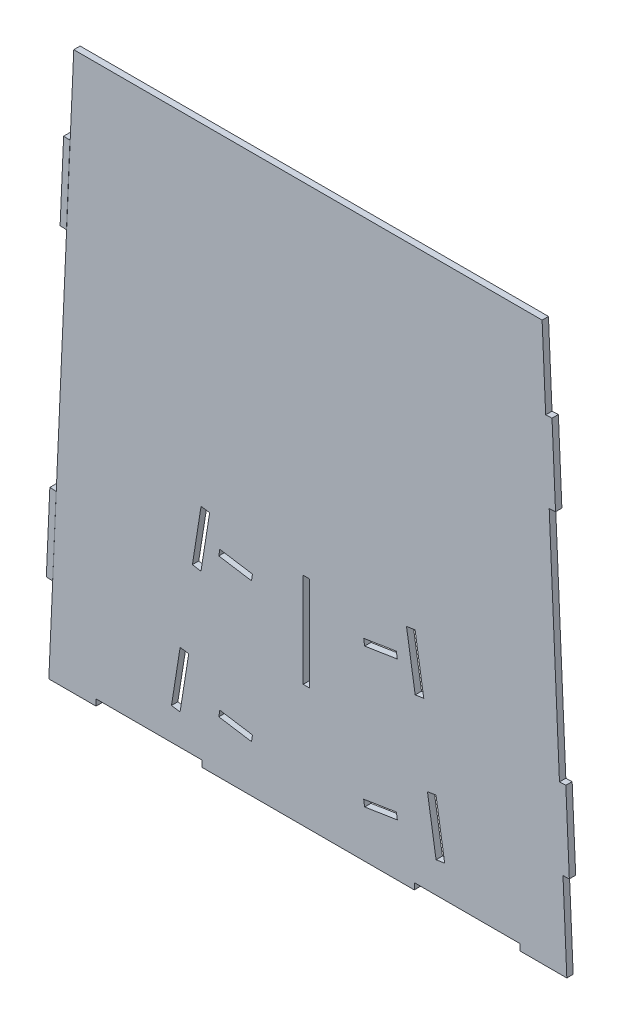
ISO-10303-21;
HEADER;
FILE_DESCRIPTION(('STEP AP214'),'2;1');
FILE_NAME('part.step','',(''),(''),'','','');
FILE_SCHEMA(('AUTOMOTIVE_DESIGN { 1 0 10303 214 1 1 1 1 }'));
ENDSEC;
DATA;
#1=APPLICATION_CONTEXT('core data for automotive mechanical design processes');
#2=APPLICATION_PROTOCOL_DEFINITION('international standard','automotive_design',2000,#1);
#3=PRODUCT_CONTEXT('',#1,'mechanical');
#4=PRODUCT('Part','Part','',(#3));
#5=PRODUCT_RELATED_PRODUCT_CATEGORY('part','',(#4));
#6=PRODUCT_DEFINITION_FORMATION('','',#4);
#7=PRODUCT_DEFINITION_CONTEXT('part definition',#1,'design');
#8=PRODUCT_DEFINITION('design','',#6,#7);
#9=PRODUCT_DEFINITION_SHAPE('','',#8);
#10=(LENGTH_UNIT() NAMED_UNIT(*) SI_UNIT(.MILLI.,.METRE.));
#11=(NAMED_UNIT(*) PLANE_ANGLE_UNIT() SI_UNIT($,.RADIAN.));
#12=(NAMED_UNIT(*) SI_UNIT($,.STERADIAN.) SOLID_ANGLE_UNIT());
#13=UNCERTAINTY_MEASURE_WITH_UNIT(LENGTH_MEASURE(1.E-05),#10,'distance_accuracy_value','');
#14=(GEOMETRIC_REPRESENTATION_CONTEXT(3) GLOBAL_UNCERTAINTY_ASSIGNED_CONTEXT((#13)) GLOBAL_UNIT_ASSIGNED_CONTEXT((#10,
#11,#12)) REPRESENTATION_CONTEXT('',''));
#15=CARTESIAN_POINT('',(0.,0.,0.));
#16=DIRECTION('',(0.,0.,1.));
#17=DIRECTION('',(1.,0.,0.));
#18=AXIS2_PLACEMENT_3D('',#15,#16,#17);
#19=CARTESIAN_POINT('',(-57.8739815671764,82.1443334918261,0.));
#20=DIRECTION('',(-0.0443029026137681,-0.999018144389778,0.));
#21=DIRECTION('',(0.999018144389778,-0.0443029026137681,0.));
#22=AXIS2_PLACEMENT_3D('',#19,#20,#21);
#23=PLANE('',#22);
#24=DIRECTION('',(0.999018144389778,-0.0443029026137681,0.));
#25=VECTOR('',#24,1.);
#26=CARTESIAN_POINT('',(-57.8739815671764,82.1443334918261,1.524));
#27=LINE('',#26,#25);
#28=CARTESIAN_POINT('',(-59.3964852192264,82.2118511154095,1.524));
#29=VERTEX_POINT('',#28);
#30=CARTESIAN_POINT('',(-57.8739815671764,82.1443334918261,1.524));
#31=VERTEX_POINT('',#30);
#32=EDGE_CURVE('E111',#29,#31,#27,.T.);
#33=ORIENTED_EDGE('',*,*,#32,.F.);
#34=DIRECTION('',(0.,0.,1.));
#35=VECTOR('',#34,1.);
#36=CARTESIAN_POINT('',(-59.3964852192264,82.2118511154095,0.));
#37=LINE('',#36,#35);
#38=CARTESIAN_POINT('',(-59.3964852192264,82.2118511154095,0.));
#39=VERTEX_POINT('',#38);
#40=EDGE_CURVE('E12',#39,#29,#37,.T.);
#41=ORIENTED_EDGE('',*,*,#40,.F.);
#42=DIRECTION('',(0.999018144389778,-0.0443029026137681,0.));
#43=VECTOR('',#42,1.);
#44=CARTESIAN_POINT('',(-57.8739815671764,82.1443334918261,0.));
#45=LINE('',#44,#43);
#46=CARTESIAN_POINT('',(-57.8739815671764,82.1443334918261,0.));
#47=VERTEX_POINT('',#46);
#48=EDGE_CURVE('E105',#39,#47,#45,.T.);
#49=ORIENTED_EDGE('',*,*,#48,.T.);
#50=DIRECTION('',(0.,0.,1.));
#51=VECTOR('',#50,1.);
#52=CARTESIAN_POINT('',(-57.8739815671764,82.1443334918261,0.));
#53=LINE('',#52,#51);
#54=EDGE_CURVE('E50',#47,#31,#53,.T.);
#55=ORIENTED_EDGE('',*,*,#54,.T.);
#56=EDGE_LOOP('',(#33,#41,#49,#55));
#57=FACE_BOUND('',#56,.T.);
#58=ADVANCED_FACE('F47',(#57),#23,.T.);
#59=CARTESIAN_POINT('',(-59.3964852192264,82.2118511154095,0.));
#60=DIRECTION('',(-0.999018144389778,0.0443029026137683,0.));
#61=DIRECTION('',(-0.0443029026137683,-0.999018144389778,0.));
#62=AXIS2_PLACEMENT_3D('',#59,#60,#61);
#63=PLANE('',#62);
#64=DIRECTION('',(-0.0443029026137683,-0.999018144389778,0.));
#65=VECTOR('',#64,1.);
#66=CARTESIAN_POINT('',(-59.3964852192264,82.2118511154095,1.524));
#67=LINE('',#66,#65);
#68=CARTESIAN_POINT('',(-58.5525149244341,101.243146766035,1.524));
#69=VERTEX_POINT('',#68);
#70=EDGE_CURVE('E107',#69,#29,#67,.T.);
#71=ORIENTED_EDGE('',*,*,#70,.F.);
#72=DIRECTION('',(0.,0.,1.));
#73=VECTOR('',#72,1.);
#74=CARTESIAN_POINT('',(-58.5525149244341,101.243146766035,0.));
#75=LINE('',#74,#73);
#76=CARTESIAN_POINT('',(-58.5525149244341,101.243146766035,0.));
#77=VERTEX_POINT('',#76);
#78=EDGE_CURVE('E56',#77,#69,#75,.T.);
#79=ORIENTED_EDGE('',*,*,#78,.F.);
#80=DIRECTION('',(-0.0443029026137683,-0.999018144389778,0.));
#81=VECTOR('',#80,1.);
#82=CARTESIAN_POINT('',(-59.3964852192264,82.2118511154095,0.));
#83=LINE('',#82,#81);
#84=EDGE_CURVE('E102',#77,#39,#83,.T.);
#85=ORIENTED_EDGE('',*,*,#84,.T.);
#86=ORIENTED_EDGE('',*,*,#40,.T.);
#87=EDGE_LOOP('',(#71,#79,#85,#86));
#88=FACE_BOUND('',#87,.T.);
#89=ADVANCED_FACE('F121',(#88),#63,.T.);
#90=CARTESIAN_POINT('',(-57.0300112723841,101.175629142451,0.));
#91=DIRECTION('',(0.0443029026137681,0.999018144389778,0.));
#92=DIRECTION('',(-0.999018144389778,0.0443029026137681,0.));
#93=AXIS2_PLACEMENT_3D('',#90,#91,#92);
#94=PLANE('',#93);
#95=DIRECTION('',(-0.999018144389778,0.0443029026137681,0.));
#96=VECTOR('',#95,1.);
#97=CARTESIAN_POINT('',(-57.0300112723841,101.175629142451,1.524));
#98=LINE('',#97,#96);
#99=CARTESIAN_POINT('',(-57.0300112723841,101.175629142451,1.524));
#100=VERTEX_POINT('',#99);
#101=EDGE_CURVE('E97',#100,#69,#98,.T.);
#102=ORIENTED_EDGE('',*,*,#101,.F.);
#103=DIRECTION('',(0.,0.,1.));
#104=VECTOR('',#103,1.);
#105=CARTESIAN_POINT('',(-57.0300112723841,101.175629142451,0.));
#106=LINE('',#105,#104);
#107=CARTESIAN_POINT('',(-57.0300112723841,101.175629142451,0.));
#108=VERTEX_POINT('',#107);
#109=EDGE_CURVE('E92',#108,#100,#106,.T.);
#110=ORIENTED_EDGE('',*,*,#109,.F.);
#111=DIRECTION('',(-0.999018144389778,0.0443029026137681,0.));
#112=VECTOR('',#111,1.);
#113=CARTESIAN_POINT('',(-57.0300112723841,101.175629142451,0.));
#114=LINE('',#113,#112);
#115=EDGE_CURVE('E95',#108,#77,#114,.T.);
#116=ORIENTED_EDGE('',*,*,#115,.T.);
#117=ORIENTED_EDGE('',*,*,#78,.T.);
#118=EDGE_LOOP('',(#102,#110,#116,#117));
#119=FACE_BOUND('',#118,.T.);
#120=ADVANCED_FACE('F94',(#119),#94,.T.);
#121=CARTESIAN_POINT('',(-57.8739815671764,82.1443334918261,0.));
#122=DIRECTION('',(0.999018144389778,-0.0443029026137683,0.));
#123=DIRECTION('',(0.0443029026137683,0.999018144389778,0.));
#124=AXIS2_PLACEMENT_3D('',#121,#122,#123);
#125=PLANE('',#124);
#126=DIRECTION('',(0.0443029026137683,0.999018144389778,0.));
#127=VECTOR('',#126,1.);
#128=CARTESIAN_POINT('',(-57.8739815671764,82.1443334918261,1.524));
#129=LINE('',#128,#127);
#130=EDGE_CURVE('E114',#31,#100,#129,.T.);
#131=ORIENTED_EDGE('',*,*,#130,.F.);
#132=ORIENTED_EDGE('',*,*,#54,.F.);
#133=DIRECTION('',(0.0443029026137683,0.999018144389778,0.));
#134=VECTOR('',#133,1.);
#135=CARTESIAN_POINT('',(-57.8739815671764,82.1443334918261,0.));
#136=LINE('',#135,#134);
#137=EDGE_CURVE('E101',#47,#108,#136,.T.);
#138=ORIENTED_EDGE('',*,*,#137,.T.);
#139=ORIENTED_EDGE('',*,*,#109,.T.);
#140=EDGE_LOOP('',(#131,#132,#138,#139));
#141=FACE_BOUND('',#140,.T.);
#142=ADVANCED_FACE('F104',(#141),#125,.T.);
#143=CARTESIAN_POINT('',(0.,0.,0.));
#144=DIRECTION('',(0.,0.,-1.));
#145=DIRECTION('',(-1.,0.,0.));
#146=AXIS2_PLACEMENT_3D('',#143,#144,#145);
#147=PLANE('',#146);
#148=ORIENTED_EDGE('',*,*,#48,.F.);
#149=ORIENTED_EDGE('',*,*,#84,.F.);
#150=ORIENTED_EDGE('',*,*,#115,.F.);
#151=ORIENTED_EDGE('',*,*,#137,.F.);
#152=EDGE_LOOP('',(#148,#149,#150,#151));
#153=FACE_BOUND('',#152,.T.);
#154=ADVANCED_FACE('F100',(#153),#147,.T.);
#155=CARTESIAN_POINT('',(0.,0.,1.524));
#156=DIRECTION('',(0.,0.,-1.));
#157=DIRECTION('',(-1.,0.,0.));
#158=AXIS2_PLACEMENT_3D('',#155,#156,#157);
#159=PLANE('',#158);
#160=ORIENTED_EDGE('',*,*,#32,.T.);
#161=ORIENTED_EDGE('',*,*,#130,.T.);
#162=ORIENTED_EDGE('',*,*,#101,.T.);
#163=ORIENTED_EDGE('',*,*,#70,.T.);
#164=EDGE_LOOP('',(#160,#161,#162,#163));
#165=FACE_BOUND('',#164,.T.);
#166=ADVANCED_FACE('F120',(#165),#159,.F.);
#167=CLOSED_SHELL('',(#58,#89,#120,#142,#154,#166));
#168=MANIFOLD_SOLID_BREP('B2',#167);
#169=CARTESIAN_POINT('',(-61.1821890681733,7.54517352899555,0.));
#170=DIRECTION('',(-0.0443029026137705,-0.999018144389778,0.));
#171=DIRECTION('',(0.999018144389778,-0.0443029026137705,0.));
#172=AXIS2_PLACEMENT_3D('',#169,#170,#171);
#173=PLANE('',#172);
#174=DIRECTION('',(0.999018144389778,-0.0443029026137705,0.));
#175=VECTOR('',#174,1.);
#176=CARTESIAN_POINT('',(-61.1821890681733,7.54517352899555,1.524));
#177=LINE('',#176,#175);
#178=CARTESIAN_POINT('',(-62.7046927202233,7.61269115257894,1.524));
#179=VERTEX_POINT('',#178);
#180=CARTESIAN_POINT('',(-61.1821890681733,7.54517352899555,1.524));
#181=VERTEX_POINT('',#180);
#182=EDGE_CURVE('E243',#179,#181,#177,.T.);
#183=ORIENTED_EDGE('',*,*,#182,.F.);
#184=DIRECTION('',(0.,0.,1.));
#185=VECTOR('',#184,1.);
#186=CARTESIAN_POINT('',(-62.7046927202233,7.61269115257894,0.));
#187=LINE('',#186,#185);
#188=CARTESIAN_POINT('',(-62.7046927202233,7.61269115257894,0.));
#189=VERTEX_POINT('',#188);
#190=EDGE_CURVE('E45',#189,#179,#187,.T.);
#191=ORIENTED_EDGE('',*,*,#190,.F.);
#192=DIRECTION('',(0.999018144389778,-0.0443029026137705,0.));
#193=VECTOR('',#192,1.);
#194=CARTESIAN_POINT('',(-61.1821890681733,7.54517352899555,0.));
#195=LINE('',#194,#193);
#196=CARTESIAN_POINT('',(-61.1821890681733,7.54517352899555,0.));
#197=VERTEX_POINT('',#196);
#198=EDGE_CURVE('E237',#189,#197,#195,.T.);
#199=ORIENTED_EDGE('',*,*,#198,.T.);
#200=DIRECTION('',(0.,0.,1.));
#201=VECTOR('',#200,1.);
#202=CARTESIAN_POINT('',(-61.1821890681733,7.54517352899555,0.));
#203=LINE('',#202,#201);
#204=EDGE_CURVE('E182',#197,#181,#203,.T.);
#205=ORIENTED_EDGE('',*,*,#204,.T.);
#206=EDGE_LOOP('',(#183,#191,#199,#205));
#207=FACE_BOUND('',#206,.T.);
#208=ADVANCED_FACE('F179',(#207),#173,.T.);
#209=CARTESIAN_POINT('',(-62.7046927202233,7.61269115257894,0.));
#210=DIRECTION('',(-0.999018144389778,0.0443029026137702,0.));
#211=DIRECTION('',(-0.0443029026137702,-0.999018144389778,0.));
#212=AXIS2_PLACEMENT_3D('',#209,#210,#211);
#213=PLANE('',#212);
#214=DIRECTION('',(-0.0443029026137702,-0.999018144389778,0.));
#215=VECTOR('',#214,1.);
#216=CARTESIAN_POINT('',(-62.7046927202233,7.61269115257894,1.524));
#217=LINE('',#216,#215);
#218=CARTESIAN_POINT('',(-61.860722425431,26.6439868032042,1.524));
#219=VERTEX_POINT('',#218);
#220=EDGE_CURVE('E239',#219,#179,#217,.T.);
#221=ORIENTED_EDGE('',*,*,#220,.F.);
#222=DIRECTION('',(0.,0.,1.));
#223=VECTOR('',#222,1.);
#224=CARTESIAN_POINT('',(-61.860722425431,26.6439868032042,0.));
#225=LINE('',#224,#223);
#226=CARTESIAN_POINT('',(-61.860722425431,26.6439868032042,0.));
#227=VERTEX_POINT('',#226);
#228=EDGE_CURVE('E188',#227,#219,#225,.T.);
#229=ORIENTED_EDGE('',*,*,#228,.F.);
#230=DIRECTION('',(-0.0443029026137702,-0.999018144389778,0.));
#231=VECTOR('',#230,1.);
#232=CARTESIAN_POINT('',(-62.7046927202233,7.61269115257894,0.));
#233=LINE('',#232,#231);
#234=EDGE_CURVE('E234',#227,#189,#233,.T.);
#235=ORIENTED_EDGE('',*,*,#234,.T.);
#236=ORIENTED_EDGE('',*,*,#190,.T.);
#237=EDGE_LOOP('',(#221,#229,#235,#236));
#238=FACE_BOUND('',#237,.T.);
#239=ADVANCED_FACE('F253',(#238),#213,.T.);
#240=CARTESIAN_POINT('',(-60.338218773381,26.5764691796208,0.));
#241=DIRECTION('',(0.0443029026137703,0.999018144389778,0.));
#242=DIRECTION('',(-0.999018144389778,0.0443029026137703,0.));
#243=AXIS2_PLACEMENT_3D('',#240,#241,#242);
#244=PLANE('',#243);
#245=DIRECTION('',(-0.999018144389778,0.0443029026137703,0.));
#246=VECTOR('',#245,1.);
#247=CARTESIAN_POINT('',(-60.338218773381,26.5764691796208,1.524));
#248=LINE('',#247,#246);
#249=CARTESIAN_POINT('',(-60.338218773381,26.5764691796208,1.524));
#250=VERTEX_POINT('',#249);
#251=EDGE_CURVE('E229',#250,#219,#248,.T.);
#252=ORIENTED_EDGE('',*,*,#251,.F.);
#253=DIRECTION('',(0.,0.,1.));
#254=VECTOR('',#253,1.);
#255=CARTESIAN_POINT('',(-60.338218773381,26.5764691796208,0.));
#256=LINE('',#255,#254);
#257=CARTESIAN_POINT('',(-60.338218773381,26.5764691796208,0.));
#258=VERTEX_POINT('',#257);
#259=EDGE_CURVE('E224',#258,#250,#256,.T.);
#260=ORIENTED_EDGE('',*,*,#259,.F.);
#261=DIRECTION('',(-0.999018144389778,0.0443029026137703,0.));
#262=VECTOR('',#261,1.);
#263=CARTESIAN_POINT('',(-60.338218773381,26.5764691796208,0.));
#264=LINE('',#263,#262);
#265=EDGE_CURVE('E227',#258,#227,#264,.T.);
#266=ORIENTED_EDGE('',*,*,#265,.T.);
#267=ORIENTED_EDGE('',*,*,#228,.T.);
#268=EDGE_LOOP('',(#252,#260,#266,#267));
#269=FACE_BOUND('',#268,.T.);
#270=ADVANCED_FACE('F226',(#269),#244,.T.);
#271=CARTESIAN_POINT('',(-61.1821890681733,7.54517352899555,0.));
#272=DIRECTION('',(0.999018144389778,-0.0443029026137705,0.));
#273=DIRECTION('',(0.0443029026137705,0.999018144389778,0.));
#274=AXIS2_PLACEMENT_3D('',#271,#272,#273);
#275=PLANE('',#274);
#276=DIRECTION('',(0.0443029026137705,0.999018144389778,0.));
#277=VECTOR('',#276,1.);
#278=CARTESIAN_POINT('',(-61.1821890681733,7.54517352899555,1.524));
#279=LINE('',#278,#277);
#280=EDGE_CURVE('E246',#181,#250,#279,.T.);
#281=ORIENTED_EDGE('',*,*,#280,.F.);
#282=ORIENTED_EDGE('',*,*,#204,.F.);
#283=DIRECTION('',(0.0443029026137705,0.999018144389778,0.));
#284=VECTOR('',#283,1.);
#285=CARTESIAN_POINT('',(-61.1821890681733,7.54517352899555,0.));
#286=LINE('',#285,#284);
#287=EDGE_CURVE('E233',#197,#258,#286,.T.);
#288=ORIENTED_EDGE('',*,*,#287,.T.);
#289=ORIENTED_EDGE('',*,*,#259,.T.);
#290=EDGE_LOOP('',(#281,#282,#288,#289));
#291=FACE_BOUND('',#290,.T.);
#292=ADVANCED_FACE('F236',(#291),#275,.T.);
#293=CARTESIAN_POINT('',(0.,0.,0.));
#294=DIRECTION('',(0.,0.,-1.));
#295=DIRECTION('',(-1.,0.,0.));
#296=AXIS2_PLACEMENT_3D('',#293,#294,#295);
#297=PLANE('',#296);
#298=ORIENTED_EDGE('',*,*,#198,.F.);
#299=ORIENTED_EDGE('',*,*,#234,.F.);
#300=ORIENTED_EDGE('',*,*,#265,.F.);
#301=ORIENTED_EDGE('',*,*,#287,.F.);
#302=EDGE_LOOP('',(#298,#299,#300,#301));
#303=FACE_BOUND('',#302,.T.);
#304=ADVANCED_FACE('F232',(#303),#297,.T.);
#305=CARTESIAN_POINT('',(0.,0.,1.524));
#306=DIRECTION('',(0.,0.,-1.));
#307=DIRECTION('',(-1.,0.,0.));
#308=AXIS2_PLACEMENT_3D('',#305,#306,#307);
#309=PLANE('',#308);
#310=ORIENTED_EDGE('',*,*,#182,.T.);
#311=ORIENTED_EDGE('',*,*,#280,.T.);
#312=ORIENTED_EDGE('',*,*,#251,.T.);
#313=ORIENTED_EDGE('',*,*,#220,.T.);
#314=EDGE_LOOP('',(#310,#311,#312,#313));
#315=FACE_BOUND('',#314,.T.);
#316=ADVANCED_FACE('F252',(#315),#309,.F.);
#317=CLOSED_SHELL('',(#208,#239,#270,#292,#304,#316));
#318=MANIFOLD_SOLID_BREP('B6',#317);
#319=CARTESIAN_POINT('',(0.,-13.2697803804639,1.524));
#320=DIRECTION('',(0.,-1.,0.));
#321=DIRECTION('',(0.,0.,-1.));
#322=AXIS2_PLACEMENT_3D('',#319,#320,#321);
#323=PLANE('',#322);
#324=DIRECTION('',(0.,0.,1.));
#325=VECTOR('',#324,1.);
#326=CARTESIAN_POINT('',(-50.791018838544,-13.2697803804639,0.));
#327=LINE('',#326,#325);
#328=CARTESIAN_POINT('',(-50.791018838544,-13.2697803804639,0.));
#329=VERTEX_POINT('',#328);
#330=CARTESIAN_POINT('',(-50.791018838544,-13.2697803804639,1.524));
#331=VERTEX_POINT('',#330);
#332=EDGE_CURVE('E961',#329,#331,#327,.T.);
#333=ORIENTED_EDGE('',*,*,#332,.T.);
#334=DIRECTION('',(-1.,0.,0.));
#335=VECTOR('',#334,1.);
#336=CARTESIAN_POINT('',(0.,-13.2697803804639,1.524));
#337=LINE('',#336,#335);
#338=CARTESIAN_POINT('',(-62.1052582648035,-13.269780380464,1.524));
#339=VERTEX_POINT('',#338);
#340=EDGE_CURVE('E1082',#331,#339,#337,.T.);
#341=ORIENTED_EDGE('',*,*,#340,.T.);
#342=DIRECTION('',(0.,0.,-1.));
#343=VECTOR('',#342,1.);
#344=CARTESIAN_POINT('',(-62.1052582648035,-13.269780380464,1.524));
#345=LINE('',#344,#343);
#346=CARTESIAN_POINT('',(-62.1052582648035,-13.269780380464,0.));
#347=VERTEX_POINT('',#346);
#348=EDGE_CURVE('E1077',#339,#347,#345,.T.);
#349=ORIENTED_EDGE('',*,*,#348,.T.);
#350=DIRECTION('',(-1.,0.,0.));
#351=VECTOR('',#350,1.);
#352=CARTESIAN_POINT('',(0.,-13.2697803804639,0.));
#353=LINE('',#352,#351);
#354=EDGE_CURVE('E1046',#329,#347,#353,.T.);
#355=ORIENTED_EDGE('',*,*,#354,.F.);
#356=EDGE_LOOP('',(#333,#341,#349,#355));
#357=FACE_BOUND('',#356,.T.);
#358=ADVANCED_FACE('F302',(#357),#323,.T.);
#359=DIRECTION('',(0.,0.,1.));
#360=VECTOR('',#359,1.);
#361=CARTESIAN_POINT('',(-25.391018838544,-13.2697803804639,0.));
#362=LINE('',#361,#360);
#363=CARTESIAN_POINT('',(-25.391018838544,-13.2697803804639,0.));
#364=VERTEX_POINT('',#363);
#365=CARTESIAN_POINT('',(-25.391018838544,-13.2697803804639,1.524));
#366=VERTEX_POINT('',#365);
#367=EDGE_CURVE('E973',#364,#366,#362,.T.);
#368=ORIENTED_EDGE('',*,*,#367,.F.);
#369=CARTESIAN_POINT('',(25.5472930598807,-13.2697803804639,0.));
#370=VERTEX_POINT('',#369);
#371=EDGE_CURVE('E1154',#370,#364,#353,.T.);
#372=ORIENTED_EDGE('',*,*,#371,.F.);
#373=DIRECTION('',(0.,0.,1.));
#374=VECTOR('',#373,1.);
#375=CARTESIAN_POINT('',(25.5472930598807,-13.2697803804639,0.));
#376=LINE('',#375,#374);
#377=CARTESIAN_POINT('',(25.5472930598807,-13.2697803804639,1.524));
#378=VERTEX_POINT('',#377);
#379=EDGE_CURVE('E987',#370,#378,#376,.T.);
#380=ORIENTED_EDGE('',*,*,#379,.T.);
#381=EDGE_CURVE('E1086',#378,#366,#337,.T.);
#382=ORIENTED_EDGE('',*,*,#381,.T.);
#383=EDGE_LOOP('',(#368,#372,#380,#382));
#384=FACE_BOUND('',#383,.T.);
#385=ADVANCED_FACE('F1176',(#384),#323,.T.);
#386=CARTESIAN_POINT('',(61.4328007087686,2.72432628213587,1.524));
#387=DIRECTION('',(0.999018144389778,0.0443029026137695,0.));
#388=DIRECTION('',(-0.0443029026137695,0.999018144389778,0.));
#389=AXIS2_PLACEMENT_3D('',#386,#387,#388);
#390=PLANE('',#389);
#391=DIRECTION('',(0.,0.,1.));
#392=VECTOR('',#391,1.);
#393=CARTESIAN_POINT('',(60.3750429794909,26.5764691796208,0.));
#394=LINE('',#393,#392);
#395=CARTESIAN_POINT('',(60.3750429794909,26.5764691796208,0.));
#396=VERTEX_POINT('',#395);
#397=CARTESIAN_POINT('',(60.3750429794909,26.5764691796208,1.524));
#398=VERTEX_POINT('',#397);
#399=EDGE_CURVE('E1020',#396,#398,#394,.T.);
#400=ORIENTED_EDGE('',*,*,#399,.F.);
#401=DIRECTION('',(0.0443029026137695,-0.999018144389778,0.));
#402=VECTOR('',#401,1.);
#403=CARTESIAN_POINT('',(61.4328007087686,2.72432628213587,0.));
#404=LINE('',#403,#402);
#405=CARTESIAN_POINT('',(57.9108057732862,82.1443334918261,0.));
#406=VERTEX_POINT('',#405);
#407=EDGE_CURVE('E1058',#406,#396,#404,.T.);
#408=ORIENTED_EDGE('',*,*,#407,.F.);
#409=DIRECTION('',(0.,0.,1.));
#410=VECTOR('',#409,1.);
#411=CARTESIAN_POINT('',(57.9108057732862,82.1443334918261,0.));
#412=LINE('',#411,#410);
#413=CARTESIAN_POINT('',(57.9108057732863,82.1443334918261,1.524));
#414=VERTEX_POINT('',#413);
#415=EDGE_CURVE('E1050',#406,#414,#412,.T.);
#416=ORIENTED_EDGE('',*,*,#415,.T.);
#417=DIRECTION('',(0.0443029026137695,-0.999018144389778,0.));
#418=VECTOR('',#417,1.);
#419=CARTESIAN_POINT('',(61.4328007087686,2.72432628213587,1.524));
#420=LINE('',#419,#418);
#421=EDGE_CURVE('E1134',#414,#398,#420,.T.);
#422=ORIENTED_EDGE('',*,*,#421,.T.);
#423=EDGE_LOOP('',(#400,#408,#416,#422));
#424=FACE_BOUND('',#423,.T.);
#425=ADVANCED_FACE('F1132',(#424),#390,.T.);
#426=DIRECTION('',(0.,0.,1.));
#427=VECTOR('',#426,1.);
#428=CARTESIAN_POINT('',(61.2190132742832,7.54517352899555,0.));
#429=LINE('',#428,#427);
#430=CARTESIAN_POINT('',(61.2190132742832,7.54517352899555,0.));
#431=VERTEX_POINT('',#430);
#432=CARTESIAN_POINT('',(61.2190132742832,7.54517352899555,1.524));
#433=VERTEX_POINT('',#432);
#434=EDGE_CURVE('E1012',#431,#433,#429,.T.);
#435=ORIENTED_EDGE('',*,*,#434,.T.);
#436=CARTESIAN_POINT('',(62.1420824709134,-13.2697803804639,1.524));
#437=VERTEX_POINT('',#436);
#438=EDGE_CURVE('E306',#433,#437,#420,.T.);
#439=ORIENTED_EDGE('',*,*,#438,.T.);
#440=DIRECTION('',(0.,0.,-1.));
#441=VECTOR('',#440,1.);
#442=CARTESIAN_POINT('',(62.1420824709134,-13.2697803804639,1.524));
#443=LINE('',#442,#441);
#444=CARTESIAN_POINT('',(62.1420824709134,-13.2697803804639,0.));
#445=VERTEX_POINT('',#444);
#446=EDGE_CURVE('E177',#437,#445,#443,.T.);
#447=ORIENTED_EDGE('',*,*,#446,.T.);
#448=EDGE_CURVE('E1056',#431,#445,#404,.T.);
#449=ORIENTED_EDGE('',*,*,#448,.F.);
#450=EDGE_LOOP('',(#435,#439,#447,#449));
#451=FACE_BOUND('',#450,.T.);
#452=ADVANCED_FACE('F1148',(#451),#390,.T.);
#453=DIRECTION('',(0.,0.,1.));
#454=VECTOR('',#453,1.);
#455=CARTESIAN_POINT('',(50.9472930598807,-13.2697803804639,0.));
#456=LINE('',#455,#454);
#457=CARTESIAN_POINT('',(50.9472930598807,-13.2697803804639,0.));
#458=VERTEX_POINT('',#457);
#459=CARTESIAN_POINT('',(50.9472930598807,-13.2697803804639,1.524));
#460=VERTEX_POINT('',#459);
#461=EDGE_CURVE('E999',#458,#460,#456,.T.);
#462=ORIENTED_EDGE('',*,*,#461,.F.);
#463=EDGE_CURVE('E1059',#445,#458,#353,.T.);
#464=ORIENTED_EDGE('',*,*,#463,.F.);
#465=ORIENTED_EDGE('',*,*,#446,.F.);
#466=EDGE_CURVE('E1088',#437,#460,#337,.T.);
#467=ORIENTED_EDGE('',*,*,#466,.T.);
#468=EDGE_LOOP('',(#462,#464,#465,#467));
#469=FACE_BOUND('',#468,.T.);
#470=ADVANCED_FACE('F304',(#469),#323,.T.);
#471=DIRECTION('',(0.,0.,1.));
#472=VECTOR('',#471,1.);
#473=CARTESIAN_POINT('',(57.066835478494,101.175629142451,0.));
#474=LINE('',#473,#472);
#475=CARTESIAN_POINT('',(57.066835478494,101.175629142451,0.));
#476=VERTEX_POINT('',#475);
#477=CARTESIAN_POINT('',(57.066835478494,101.175629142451,1.524));
#478=VERTEX_POINT('',#477);
#479=EDGE_CURVE('E1043',#476,#478,#474,.T.);
#480=ORIENTED_EDGE('',*,*,#479,.F.);
#481=CARTESIAN_POINT('',(56.2129587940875,120.430311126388,0.));
#482=VERTEX_POINT('',#481);
#483=EDGE_CURVE('E1071',#482,#476,#404,.T.);
#484=ORIENTED_EDGE('',*,*,#483,.F.);
#485=DIRECTION('',(0.,0.,-1.));
#486=VECTOR('',#485,1.);
#487=CARTESIAN_POINT('',(56.2129587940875,120.430311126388,1.524));
#488=LINE('',#487,#486);
#489=CARTESIAN_POINT('',(56.2129587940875,120.430311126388,1.524));
#490=VERTEX_POINT('',#489);
#491=EDGE_CURVE('E312',#490,#482,#488,.T.);
#492=ORIENTED_EDGE('',*,*,#491,.F.);
#493=EDGE_CURVE('E1103',#490,#478,#420,.T.);
#494=ORIENTED_EDGE('',*,*,#493,.T.);
#495=EDGE_LOOP('',(#480,#484,#492,#494));
#496=FACE_BOUND('',#495,.T.);
#497=ADVANCED_FACE('F1102',(#496),#390,.T.);
#498=CARTESIAN_POINT('',(0.,120.430311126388,1.524));
#499=DIRECTION('',(0.,1.,0.));
#500=DIRECTION('',(0.,0.,1.));
#501=AXIS2_PLACEMENT_3D('',#498,#499,#500);
#502=PLANE('',#501);
#503=DIRECTION('',(1.,0.,0.));
#504=VECTOR('',#503,1.);
#505=CARTESIAN_POINT('',(0.,120.430311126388,0.));
#506=LINE('',#505,#504);
#507=CARTESIAN_POINT('',(-56.1207926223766,120.430311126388,0.));
#508=VERTEX_POINT('',#507);
#509=EDGE_CURVE('E1064',#508,#482,#506,.T.);
#510=ORIENTED_EDGE('',*,*,#509,.F.);
#511=DIRECTION('',(0.,0.,-1.));
#512=VECTOR('',#511,1.);
#513=CARTESIAN_POINT('',(-56.1207926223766,120.430311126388,1.524));
#514=LINE('',#513,#512);
#515=CARTESIAN_POINT('',(-56.1207926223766,120.430311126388,1.524));
#516=VERTEX_POINT('',#515);
#517=EDGE_CURVE('E1075',#516,#508,#514,.T.);
#518=ORIENTED_EDGE('',*,*,#517,.F.);
#519=DIRECTION('',(1.,0.,0.));
#520=VECTOR('',#519,1.);
#521=CARTESIAN_POINT('',(0.,120.430311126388,1.524));
#522=LINE('',#521,#520);
#523=EDGE_CURVE('E1097',#516,#490,#522,.T.);
#524=ORIENTED_EDGE('',*,*,#523,.T.);
#525=ORIENTED_EDGE('',*,*,#491,.T.);
#526=EDGE_LOOP('',(#510,#518,#524,#525));
#527=FACE_BOUND('',#526,.T.);
#528=ADVANCED_FACE('F1094',(#527),#502,.T.);
#529=CARTESIAN_POINT('',(-61.3883070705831,2.74776337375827,1.524));
#530=DIRECTION('',(-0.998999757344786,0.0447155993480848,0.));
#531=DIRECTION('',(-0.0447155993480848,-0.998999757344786,0.));
#532=AXIS2_PLACEMENT_3D('',#529,#530,#531);
#533=PLANE('',#532);
#534=DIRECTION('',(0.0447155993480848,0.998999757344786,0.));
#535=VECTOR('',#534,1.);
#536=CARTESIAN_POINT('',(-61.3883070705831,2.74776337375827,0.));
#537=LINE('',#536,#535);
#538=EDGE_CURVE('E1080',#347,#508,#537,.T.);
#539=ORIENTED_EDGE('',*,*,#538,.F.);
#540=ORIENTED_EDGE('',*,*,#348,.F.);
#541=DIRECTION('',(0.0447155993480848,0.998999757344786,0.));
#542=VECTOR('',#541,1.);
#543=CARTESIAN_POINT('',(-61.3883070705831,2.74776337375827,1.524));
#544=LINE('',#543,#542);
#545=EDGE_CURVE('E1079',#339,#516,#544,.T.);
#546=ORIENTED_EDGE('',*,*,#545,.T.);
#547=ORIENTED_EDGE('',*,*,#517,.T.);
#548=EDGE_LOOP('',(#539,#540,#546,#547));
#549=FACE_BOUND('',#548,.T.);
#550=ADVANCED_FACE('F1164',(#549),#533,.T.);
#551=CARTESIAN_POINT('',(0.,0.,1.524));
#552=DIRECTION('',(0.,0.,1.));
#553=DIRECTION('',(1.,0.,0.));
#554=AXIS2_PLACEMENT_3D('',#551,#552,#553);
#555=PLANE('',#554);
#556=DIRECTION('',(-0.987765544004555,0.155946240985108,0.));
#557=VECTOR('',#556,1.);
#558=CARTESIAN_POINT('',(-21.3335944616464,-0.752677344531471,1.524));
#559=LINE('',#558,#557);
#560=CARTESIAN_POINT('',(-13.4932054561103,-1.99050063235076,1.524));
#561=VERTEX_POINT('',#560);
#562=CARTESIAN_POINT('',(-21.3335944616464,-0.752677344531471,1.524));
#563=VERTEX_POINT('',#562);
#564=EDGE_CURVE('E660',#561,#563,#559,.T.);
#565=ORIENTED_EDGE('',*,*,#564,.T.);
#566=DIRECTION('',(0.155946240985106,0.987765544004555,0.));
#567=VECTOR('',#566,1.);
#568=CARTESIAN_POINT('',(-21.3335944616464,-0.752677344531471,1.524));
#569=LINE('',#568,#567);
#570=CARTESIAN_POINT('',(-21.0959323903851,0.752677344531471,1.524));
#571=VERTEX_POINT('',#570);
#572=EDGE_CURVE('E669',#563,#571,#569,.T.);
#573=ORIENTED_EDGE('',*,*,#572,.T.);
#574=DIRECTION('',(0.987765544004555,-0.155946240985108,0.));
#575=VECTOR('',#574,1.);
#576=CARTESIAN_POINT('',(-21.0959323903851,0.752677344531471,1.524));
#577=LINE('',#576,#575);
#578=CARTESIAN_POINT('',(-13.255543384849,-0.485145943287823,1.524));
#579=VERTEX_POINT('',#578);
#580=EDGE_CURVE('E320',#571,#579,#577,.T.);
#581=ORIENTED_EDGE('',*,*,#580,.T.);
#582=DIRECTION('',(-0.155946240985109,-0.987765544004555,0.));
#583=VECTOR('',#582,1.);
#584=CARTESIAN_POINT('',(-13.4932054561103,-1.99050063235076,1.524));
#585=LINE('',#584,#583);
#586=EDGE_CURVE('E666',#579,#561,#585,.T.);
#587=ORIENTED_EDGE('',*,*,#586,.T.);
#588=EDGE_LOOP('',(#565,#573,#581,#587));
#589=FACE_BOUND('',#588,.T.);
#590=DIRECTION('',(-0.987765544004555,0.155946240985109,0.));
#591=VECTOR('',#590,1.);
#592=CARTESIAN_POINT('',(-21.3335944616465,32.6614311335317,1.524));
#593=LINE('',#592,#591);
#594=CARTESIAN_POINT('',(-13.4932054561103,31.4236078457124,1.524));
#595=VERTEX_POINT('',#594);
#596=CARTESIAN_POINT('',(-21.3335944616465,32.6614311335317,1.524));
#597=VERTEX_POINT('',#596);
#598=EDGE_CURVE('E695',#595,#597,#593,.T.);
#599=ORIENTED_EDGE('',*,*,#598,.T.);
#600=DIRECTION('',(0.15594624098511,0.987765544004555,0.));
#601=VECTOR('',#600,1.);
#602=CARTESIAN_POINT('',(-21.3335944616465,32.6614311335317,1.524));
#603=LINE('',#602,#601);
#604=CARTESIAN_POINT('',(-21.0959323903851,34.1667858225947,1.524));
#605=VERTEX_POINT('',#604);
#606=EDGE_CURVE('E698',#597,#605,#603,.T.);
#607=ORIENTED_EDGE('',*,*,#606,.T.);
#608=DIRECTION('',(0.987765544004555,-0.155946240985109,0.));
#609=VECTOR('',#608,1.);
#610=CARTESIAN_POINT('',(-21.0959323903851,34.1667858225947,1.524));
#611=LINE('',#610,#609);
#612=CARTESIAN_POINT('',(-13.255543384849,32.9289625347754,1.524));
#613=VERTEX_POINT('',#612);
#614=EDGE_CURVE('E702',#605,#613,#611,.T.);
#615=ORIENTED_EDGE('',*,*,#614,.T.);
#616=DIRECTION('',(-0.155946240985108,-0.987765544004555,0.));
#617=VECTOR('',#616,1.);
#618=CARTESIAN_POINT('',(-13.4932054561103,31.4236078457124,1.524));
#619=LINE('',#618,#617);
#620=EDGE_CURVE('E705',#613,#595,#619,.T.);
#621=ORIENTED_EDGE('',*,*,#620,.T.);
#622=EDGE_LOOP('',(#599,#607,#615,#621));
#623=FACE_BOUND('',#622,.T.);
#624=DIRECTION('',(0.155946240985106,-0.987765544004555,0.));
#625=VECTOR('',#624,1.);
#626=CARTESIAN_POINT('',(21.4897791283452,-0.752677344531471,1.524));
#627=LINE('',#626,#625);
#628=CARTESIAN_POINT('',(21.2521170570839,0.752677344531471,1.524));
#629=VERTEX_POINT('',#628);
#630=CARTESIAN_POINT('',(21.4897791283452,-0.752677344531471,1.524));
#631=VERTEX_POINT('',#630);
#632=EDGE_CURVE('E727',#629,#631,#627,.T.);
#633=ORIENTED_EDGE('',*,*,#632,.T.);
#634=DIRECTION('',(-0.987765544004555,-0.155946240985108,0.));
#635=VECTOR('',#634,1.);
#636=CARTESIAN_POINT('',(21.4897791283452,-0.752677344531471,1.524));
#637=LINE('',#636,#635);
#638=CARTESIAN_POINT('',(13.649390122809,-1.99050063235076,1.524));
#639=VERTEX_POINT('',#638);
#640=EDGE_CURVE('E730',#631,#639,#637,.T.);
#641=ORIENTED_EDGE('',*,*,#640,.T.);
#642=DIRECTION('',(-0.155946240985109,0.987765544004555,0.));
#643=VECTOR('',#642,1.);
#644=CARTESIAN_POINT('',(13.649390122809,-1.99050063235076,1.524));
#645=LINE('',#644,#643);
#646=CARTESIAN_POINT('',(13.4117280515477,-0.485145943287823,1.524));
#647=VERTEX_POINT('',#646);
#648=EDGE_CURVE('E734',#639,#647,#645,.T.);
#649=ORIENTED_EDGE('',*,*,#648,.T.);
#650=DIRECTION('',(0.987765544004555,0.155946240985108,0.));
#651=VECTOR('',#650,1.);
#652=CARTESIAN_POINT('',(21.2521170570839,0.752677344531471,1.524));
#653=LINE('',#652,#651);
#654=EDGE_CURVE('E737',#647,#629,#653,.T.);
#655=ORIENTED_EDGE('',*,*,#654,.T.);
#656=EDGE_LOOP('',(#633,#641,#649,#655));
#657=FACE_BOUND('',#656,.T.);
#658=DIRECTION('',(0.15594624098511,-0.987765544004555,0.));
#659=VECTOR('',#658,1.);
#660=CARTESIAN_POINT('',(21.4897791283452,32.6614311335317,1.524));
#661=LINE('',#660,#659);
#662=CARTESIAN_POINT('',(21.2521170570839,34.1667858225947,1.524));
#663=VERTEX_POINT('',#662);
#664=CARTESIAN_POINT('',(21.4897791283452,32.6614311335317,1.524));
#665=VERTEX_POINT('',#664);
#666=EDGE_CURVE('E759',#663,#665,#661,.T.);
#667=ORIENTED_EDGE('',*,*,#666,.T.);
#668=DIRECTION('',(-0.987765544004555,-0.155946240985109,0.));
#669=VECTOR('',#668,1.);
#670=CARTESIAN_POINT('',(21.4897791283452,32.6614311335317,1.524));
#671=LINE('',#670,#669);
#672=CARTESIAN_POINT('',(13.649390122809,31.4236078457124,1.524));
#673=VERTEX_POINT('',#672);
#674=EDGE_CURVE('E762',#665,#673,#671,.T.);
#675=ORIENTED_EDGE('',*,*,#674,.T.);
#676=DIRECTION('',(-0.155946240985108,0.987765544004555,0.));
#677=VECTOR('',#676,1.);
#678=CARTESIAN_POINT('',(13.6493901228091,31.4236078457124,1.524));
#679=LINE('',#678,#677);
#680=CARTESIAN_POINT('',(13.4117280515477,32.9289625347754,1.524));
#681=VERTEX_POINT('',#680);
#682=EDGE_CURVE('E766',#673,#681,#679,.T.);
#683=ORIENTED_EDGE('',*,*,#682,.T.);
#684=DIRECTION('',(0.987765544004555,0.155946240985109,0.));
#685=VECTOR('',#684,1.);
#686=CARTESIAN_POINT('',(21.2521170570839,34.1667858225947,1.524));
#687=LINE('',#686,#685);
#688=EDGE_CURVE('E769',#681,#663,#687,.T.);
#689=ORIENTED_EDGE('',*,*,#688,.T.);
#690=EDGE_LOOP('',(#667,#675,#683,#689));
#691=FACE_BOUND('',#690,.T.);
#692=DIRECTION('',(0.,1.,0.));
#693=VECTOR('',#692,1.);
#694=CARTESIAN_POINT('',(-1.09265944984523,38.7700402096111,1.524));
#695=LINE('',#694,#693);
#696=CARTESIAN_POINT('',(-1.09265944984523,16.1110893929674,1.524));
#697=VERTEX_POINT('',#696);
#698=CARTESIAN_POINT('',(-1.09265944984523,38.7700402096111,1.524));
#699=VERTEX_POINT('',#698);
#700=EDGE_CURVE('E791',#697,#699,#695,.T.);
#701=ORIENTED_EDGE('',*,*,#700,.T.);
#702=DIRECTION('',(1.,0.,0.));
#703=VECTOR('',#702,1.);
#704=CARTESIAN_POINT('',(0.43134055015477,38.7700402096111,1.524));
#705=LINE('',#704,#703);
#706=CARTESIAN_POINT('',(0.43134055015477,38.7700402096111,1.524));
#707=VERTEX_POINT('',#706);
#708=EDGE_CURVE('E794',#699,#707,#705,.T.);
#709=ORIENTED_EDGE('',*,*,#708,.T.);
#710=DIRECTION('',(0.,-1.,0.));
#711=VECTOR('',#710,1.);
#712=CARTESIAN_POINT('',(0.43134055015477,38.7700402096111,1.524));
#713=LINE('',#712,#711);
#714=CARTESIAN_POINT('',(0.431340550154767,16.1110893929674,1.524));
#715=VERTEX_POINT('',#714);
#716=EDGE_CURVE('E798',#707,#715,#713,.T.);
#717=ORIENTED_EDGE('',*,*,#716,.T.);
#718=DIRECTION('',(-1.,0.,0.));
#719=VECTOR('',#718,1.);
#720=CARTESIAN_POINT('',(0.431340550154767,16.1110893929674,1.524));
#721=LINE('',#720,#719);
#722=EDGE_CURVE('E801',#715,#697,#721,.T.);
#723=ORIENTED_EDGE('',*,*,#722,.T.);
#724=EDGE_LOOP('',(#701,#709,#717,#723));
#725=FACE_BOUND('',#724,.T.);
#726=DIRECTION('',(0.987765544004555,0.155946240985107,0.));
#727=VECTOR('',#726,1.);
#728=CARTESIAN_POINT('',(25.7432816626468,40.8591177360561,1.524));
#729=LINE('',#728,#727);
#730=CARTESIAN_POINT('',(23.6872757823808,40.5345200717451,1.524));
#731=VERTEX_POINT('',#730);
#732=CARTESIAN_POINT('',(25.7432816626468,40.8591177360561,1.524));
#733=VERTEX_POINT('',#732);
#734=EDGE_CURVE('E823',#731,#733,#729,.T.);
#735=ORIENTED_EDGE('',*,*,#734,.T.);
#736=DIRECTION('',(0.155946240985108,-0.987765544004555,0.));
#737=VECTOR('',#736,1.);
#738=CARTESIAN_POINT('',(25.7432816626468,40.8591177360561,1.524));
#739=LINE('',#738,#737);
#740=CARTESIAN_POINT('',(27.8242515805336,27.6782268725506,1.524));
#741=VERTEX_POINT('',#740);
#742=EDGE_CURVE('E826',#733,#741,#739,.T.);
#743=ORIENTED_EDGE('',*,*,#742,.T.);
#744=DIRECTION('',(-0.987765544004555,-0.155946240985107,0.));
#745=VECTOR('',#744,1.);
#746=CARTESIAN_POINT('',(27.8242515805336,27.6782268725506,1.524));
#747=LINE('',#746,#745);
#748=CARTESIAN_POINT('',(25.7682457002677,27.3536292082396,1.524));
#749=VERTEX_POINT('',#748);
#750=EDGE_CURVE('E830',#741,#749,#747,.T.);
#751=ORIENTED_EDGE('',*,*,#750,.T.);
#752=DIRECTION('',(-0.155946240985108,0.987765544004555,0.));
#753=VECTOR('',#752,1.);
#754=CARTESIAN_POINT('',(23.6872757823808,40.5345200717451,1.524));
#755=LINE('',#754,#753);
#756=EDGE_CURVE('E833',#749,#731,#755,.T.);
#757=ORIENTED_EDGE('',*,*,#756,.T.);
#758=EDGE_LOOP('',(#735,#743,#751,#757));
#759=FACE_BOUND('',#758,.T.);
#760=DIRECTION('',(0.987765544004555,0.155946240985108,0.));
#761=VECTOR('',#760,1.);
#762=CARTESIAN_POINT('',(28.7101682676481,8.71945292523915,1.524));
#763=LINE('',#762,#761);
#764=CARTESIAN_POINT('',(28.7101682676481,8.71945292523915,1.524));
#765=VERTEX_POINT('',#764);
#766=CARTESIAN_POINT('',(30.766174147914,9.04405058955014,1.524));
#767=VERTEX_POINT('',#766);
#768=EDGE_CURVE('E855',#765,#767,#763,.T.);
#769=ORIENTED_EDGE('',*,*,#768,.T.);
#770=DIRECTION('',(0.155946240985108,-0.987765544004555,0.));
#771=VECTOR('',#770,1.);
#772=CARTESIAN_POINT('',(30.766174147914,9.04405058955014,1.524));
#773=LINE('',#772,#771);
#774=CARTESIAN_POINT('',(32.8351320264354,-4.06075585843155,1.524));
#775=VERTEX_POINT('',#774);
#776=EDGE_CURVE('E858',#767,#775,#773,.T.);
#777=ORIENTED_EDGE('',*,*,#776,.T.);
#778=DIRECTION('',(-0.987765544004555,-0.155946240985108,0.));
#779=VECTOR('',#778,1.);
#780=CARTESIAN_POINT('',(32.8351320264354,-4.06075585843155,1.524));
#781=LINE('',#780,#779);
#782=CARTESIAN_POINT('',(30.7791261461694,-4.38535352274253,1.524));
#783=VERTEX_POINT('',#782);
#784=EDGE_CURVE('E862',#775,#783,#781,.T.);
#785=ORIENTED_EDGE('',*,*,#784,.T.);
#786=DIRECTION('',(-0.155946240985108,0.987765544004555,0.));
#787=VECTOR('',#786,1.);
#788=CARTESIAN_POINT('',(28.7101682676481,8.71945292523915,1.524));
#789=LINE('',#788,#787);
#790=EDGE_CURVE('E865',#783,#765,#789,.T.);
#791=ORIENTED_EDGE('',*,*,#790,.T.);
#792=EDGE_LOOP('',(#769,#777,#785,#791));
#793=FACE_BOUND('',#792,.T.);
#794=DIRECTION('',(0.987765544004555,-0.155946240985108,0.));
#795=VECTOR('',#794,1.);
#796=CARTESIAN_POINT('',(-28.5539836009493,8.71945292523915,1.524));
#797=LINE('',#796,#795);
#798=CARTESIAN_POINT('',(-30.6099894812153,9.04405058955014,1.524));
#799=VERTEX_POINT('',#798);
#800=CARTESIAN_POINT('',(-28.5539836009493,8.71945292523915,1.524));
#801=VERTEX_POINT('',#800);
#802=EDGE_CURVE('E887',#799,#801,#797,.T.);
#803=ORIENTED_EDGE('',*,*,#802,.T.);
#804=DIRECTION('',(-0.155946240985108,-0.987765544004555,0.));
#805=VECTOR('',#804,1.);
#806=CARTESIAN_POINT('',(-28.5539836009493,8.71945292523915,1.524));
#807=LINE('',#806,#805);
#808=CARTESIAN_POINT('',(-30.6229414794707,-4.38535352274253,1.524));
#809=VERTEX_POINT('',#808);
#810=EDGE_CURVE('E890',#801,#809,#807,.T.);
#811=ORIENTED_EDGE('',*,*,#810,.T.);
#812=DIRECTION('',(-0.987765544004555,0.155946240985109,0.));
#813=VECTOR('',#812,1.);
#814=CARTESIAN_POINT('',(-32.6789473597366,-4.06075585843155,1.524));
#815=LINE('',#814,#813);
#816=CARTESIAN_POINT('',(-32.6789473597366,-4.06075585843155,1.524));
#817=VERTEX_POINT('',#816);
#818=EDGE_CURVE('E894',#809,#817,#815,.T.);
#819=ORIENTED_EDGE('',*,*,#818,.T.);
#820=DIRECTION('',(0.155946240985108,0.987765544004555,0.));
#821=VECTOR('',#820,1.);
#822=CARTESIAN_POINT('',(-30.6099894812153,9.04405058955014,1.524));
#823=LINE('',#822,#821);
#824=EDGE_CURVE('E897',#817,#799,#823,.T.);
#825=ORIENTED_EDGE('',*,*,#824,.T.);
#826=EDGE_LOOP('',(#803,#811,#819,#825));
#827=FACE_BOUND('',#826,.T.);
#828=DIRECTION('',(0.987765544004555,-0.155946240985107,0.));
#829=VECTOR('',#828,1.);
#830=CARTESIAN_POINT('',(-25.587096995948,40.8591177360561,1.524));
#831=LINE('',#830,#829);
#832=CARTESIAN_POINT('',(-25.587096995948,40.8591177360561,1.524));
#833=VERTEX_POINT('',#832);
#834=CARTESIAN_POINT('',(-23.5310911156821,40.5345200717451,1.524));
#835=VERTEX_POINT('',#834);
#836=EDGE_CURVE('E919',#833,#835,#831,.T.);
#837=ORIENTED_EDGE('',*,*,#836,.T.);
#838=DIRECTION('',(-0.155946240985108,-0.987765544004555,0.));
#839=VECTOR('',#838,1.);
#840=CARTESIAN_POINT('',(-23.5310911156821,40.5345200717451,1.524));
#841=LINE('',#840,#839);
#842=CARTESIAN_POINT('',(-25.612061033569,27.3536292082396,1.524));
#843=VERTEX_POINT('',#842);
#844=EDGE_CURVE('E922',#835,#843,#841,.T.);
#845=ORIENTED_EDGE('',*,*,#844,.T.);
#846=DIRECTION('',(-0.987765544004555,0.155946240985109,0.));
#847=VECTOR('',#846,1.);
#848=CARTESIAN_POINT('',(-27.6680669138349,27.6782268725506,1.524));
#849=LINE('',#848,#847);
#850=CARTESIAN_POINT('',(-27.6680669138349,27.6782268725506,1.524));
#851=VERTEX_POINT('',#850);
#852=EDGE_CURVE('E926',#843,#851,#849,.T.);
#853=ORIENTED_EDGE('',*,*,#852,.T.);
#854=DIRECTION('',(0.155946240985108,0.987765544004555,0.));
#855=VECTOR('',#854,1.);
#856=CARTESIAN_POINT('',(-25.587096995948,40.8591177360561,1.524));
#857=LINE('',#856,#855);
#858=EDGE_CURVE('E929',#851,#833,#857,.T.);
#859=ORIENTED_EDGE('',*,*,#858,.T.);
#860=EDGE_LOOP('',(#837,#845,#853,#859));
#861=FACE_BOUND('',#860,.T.);
#862=DIRECTION('',(0.,-1.,0.));
#863=VECTOR('',#862,1.);
#864=CARTESIAN_POINT('',(-50.791018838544,-11.745780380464,1.524));
#865=LINE('',#864,#863);
#866=CARTESIAN_POINT('',(-50.791018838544,-11.745780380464,1.524));
#867=VERTEX_POINT('',#866);
#868=EDGE_CURVE('E944',#867,#331,#865,.T.);
#869=ORIENTED_EDGE('',*,*,#868,.F.);
#870=DIRECTION('',(-1.,0.,0.));
#871=VECTOR('',#870,1.);
#872=CARTESIAN_POINT('',(-50.791018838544,-11.745780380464,1.524));
#873=LINE('',#872,#871);
#874=CARTESIAN_POINT('',(-25.391018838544,-11.745780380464,1.524));
#875=VERTEX_POINT('',#874);
#876=EDGE_CURVE('E955',#875,#867,#873,.T.);
#877=ORIENTED_EDGE('',*,*,#876,.F.);
#878=DIRECTION('',(0.,1.,0.));
#879=VECTOR('',#878,1.);
#880=CARTESIAN_POINT('',(-25.391018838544,-11.745780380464,1.524));
#881=LINE('',#880,#879);
#882=EDGE_CURVE('E963',#366,#875,#881,.T.);
#883=ORIENTED_EDGE('',*,*,#882,.F.);
#884=ORIENTED_EDGE('',*,*,#381,.F.);
#885=DIRECTION('',(0.,-1.,0.));
#886=VECTOR('',#885,1.);
#887=CARTESIAN_POINT('',(25.5472930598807,-11.745780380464,1.524));
#888=LINE('',#887,#886);
#889=CARTESIAN_POINT('',(25.5472930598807,-11.745780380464,1.524));
#890=VERTEX_POINT('',#889);
#891=EDGE_CURVE('E970',#890,#378,#888,.T.);
#892=ORIENTED_EDGE('',*,*,#891,.F.);
#893=DIRECTION('',(-1.,0.,0.));
#894=VECTOR('',#893,1.);
#895=CARTESIAN_POINT('',(25.5472930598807,-11.745780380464,1.524));
#896=LINE('',#895,#894);
#897=CARTESIAN_POINT('',(50.9472930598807,-11.745780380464,1.524));
#898=VERTEX_POINT('',#897);
#899=EDGE_CURVE('E981',#898,#890,#896,.T.);
#900=ORIENTED_EDGE('',*,*,#899,.F.);
#901=DIRECTION('',(0.,1.,0.));
#902=VECTOR('',#901,1.);
#903=CARTESIAN_POINT('',(50.9472930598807,-11.745780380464,1.524));
#904=LINE('',#903,#902);
#905=EDGE_CURVE('E989',#460,#898,#904,.T.);
#906=ORIENTED_EDGE('',*,*,#905,.F.);
#907=ORIENTED_EDGE('',*,*,#466,.F.);
#908=ORIENTED_EDGE('',*,*,#438,.F.);
#909=DIRECTION('',(0.999018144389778,0.0443029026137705,0.));
#910=VECTOR('',#909,1.);
#911=CARTESIAN_POINT('',(61.2190132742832,7.54517352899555,1.524));
#912=LINE('',#911,#910);
#913=CARTESIAN_POINT('',(62.7415169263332,7.61269115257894,1.524));
#914=VERTEX_POINT('',#913);
#915=EDGE_CURVE('E996',#433,#914,#912,.T.);
#916=ORIENTED_EDGE('',*,*,#915,.T.);
#917=DIRECTION('',(-0.0443029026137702,0.999018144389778,0.));
#918=VECTOR('',#917,1.);
#919=CARTESIAN_POINT('',(62.7415169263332,7.61269115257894,1.524));
#920=LINE('',#919,#918);
#921=CARTESIAN_POINT('',(61.8975466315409,26.6439868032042,1.524));
#922=VERTEX_POINT('',#921);
#923=EDGE_CURVE('E1015',#914,#922,#920,.T.);
#924=ORIENTED_EDGE('',*,*,#923,.T.);
#925=DIRECTION('',(-0.999018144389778,-0.0443029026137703,0.));
#926=VECTOR('',#925,1.);
#927=CARTESIAN_POINT('',(60.3750429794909,26.5764691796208,1.524));
#928=LINE('',#927,#926);
#929=EDGE_CURVE('E1007',#922,#398,#928,.T.);
#930=ORIENTED_EDGE('',*,*,#929,.T.);
#931=ORIENTED_EDGE('',*,*,#421,.F.);
#932=DIRECTION('',(0.999018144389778,0.0443029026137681,0.));
#933=VECTOR('',#932,1.);
#934=CARTESIAN_POINT('',(57.9108057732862,82.1443334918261,1.524));
#935=LINE('',#934,#933);
#936=CARTESIAN_POINT('',(59.4333094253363,82.2118511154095,1.524));
#937=VERTEX_POINT('',#936);
#938=EDGE_CURVE('E1022',#414,#937,#935,.T.);
#939=ORIENTED_EDGE('',*,*,#938,.T.);
#940=DIRECTION('',(-0.0443029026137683,0.999018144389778,0.));
#941=VECTOR('',#940,1.);
#942=CARTESIAN_POINT('',(59.4333094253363,82.2118511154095,1.524));
#943=LINE('',#942,#941);
#944=CARTESIAN_POINT('',(58.589339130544,101.243146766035,1.524));
#945=VERTEX_POINT('',#944);
#946=EDGE_CURVE('E1034',#937,#945,#943,.T.);
#947=ORIENTED_EDGE('',*,*,#946,.T.);
#948=DIRECTION('',(-0.999018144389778,-0.0443029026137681,0.));
#949=VECTOR('',#948,1.);
#950=CARTESIAN_POINT('',(57.066835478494,101.175629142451,1.524));
#951=LINE('',#950,#949);
#952=EDGE_CURVE('E1037',#945,#478,#951,.T.);
#953=ORIENTED_EDGE('',*,*,#952,.T.);
#954=ORIENTED_EDGE('',*,*,#493,.F.);
#955=ORIENTED_EDGE('',*,*,#523,.F.);
#956=ORIENTED_EDGE('',*,*,#545,.F.);
#957=ORIENTED_EDGE('',*,*,#340,.F.);
#958=EDGE_LOOP('',(#869,#877,#883,#884,#892,#900,#906,#907,#908,#916,#924,#930,#931,#939,#947,
#953,#954,#955,#956,#957));
#959=FACE_BOUND('',#958,.T.);
#960=ADVANCED_FACE('F673',(#589,#623,#657,#691,#725,#759,#793,#827,#861,#959),#555,.T.);
#961=CARTESIAN_POINT('',(0.,0.,0.));
#962=DIRECTION('',(0.,0.,1.));
#963=DIRECTION('',(1.,0.,0.));
#964=AXIS2_PLACEMENT_3D('',#961,#962,#963);
#965=PLANE('',#964);
#966=DIRECTION('',(0.155946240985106,0.987765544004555,0.));
#967=VECTOR('',#966,1.);
#968=CARTESIAN_POINT('',(-21.3335944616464,-0.752677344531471,0.));
#969=LINE('',#968,#967);
#970=CARTESIAN_POINT('',(-21.3335944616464,-0.752677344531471,0.));
#971=VERTEX_POINT('',#970);
#972=CARTESIAN_POINT('',(-21.0959323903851,0.752677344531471,0.));
#973=VERTEX_POINT('',#972);
#974=EDGE_CURVE('E685',#971,#973,#969,.T.);
#975=ORIENTED_EDGE('',*,*,#974,.F.);
#976=DIRECTION('',(-0.987765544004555,0.155946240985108,0.));
#977=VECTOR('',#976,1.);
#978=CARTESIAN_POINT('',(-21.3335944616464,-0.752677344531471,0.));
#979=LINE('',#978,#977);
#980=CARTESIAN_POINT('',(-13.4932054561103,-1.99050063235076,0.));
#981=VERTEX_POINT('',#980);
#982=EDGE_CURVE('E328',#981,#971,#979,.T.);
#983=ORIENTED_EDGE('',*,*,#982,.F.);
#984=DIRECTION('',(-0.155946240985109,-0.987765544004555,0.));
#985=VECTOR('',#984,1.);
#986=CARTESIAN_POINT('',(-13.4932054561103,-1.99050063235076,0.));
#987=LINE('',#986,#985);
#988=CARTESIAN_POINT('',(-13.255543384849,-0.485145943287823,0.));
#989=VERTEX_POINT('',#988);
#990=EDGE_CURVE('E676',#989,#981,#987,.T.);
#991=ORIENTED_EDGE('',*,*,#990,.F.);
#992=DIRECTION('',(0.987765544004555,-0.155946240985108,0.));
#993=VECTOR('',#992,1.);
#994=CARTESIAN_POINT('',(-21.0959323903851,0.752677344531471,0.));
#995=LINE('',#994,#993);
#996=EDGE_CURVE('E679',#973,#989,#995,.T.);
#997=ORIENTED_EDGE('',*,*,#996,.F.);
#998=EDGE_LOOP('',(#975,#983,#991,#997));
#999=FACE_BOUND('',#998,.T.);
#1000=DIRECTION('',(0.15594624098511,0.987765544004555,0.));
#1001=VECTOR('',#1000,1.);
#1002=CARTESIAN_POINT('',(-21.3335944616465,32.6614311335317,0.));
#1003=LINE('',#1002,#1001);
#1004=CARTESIAN_POINT('',(-21.3335944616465,32.6614311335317,0.));
#1005=VERTEX_POINT('',#1004);
#1006=CARTESIAN_POINT('',(-21.0959323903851,34.1667858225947,0.));
#1007=VERTEX_POINT('',#1006);
#1008=EDGE_CURVE('E710',#1005,#1007,#1003,.T.);
#1009=ORIENTED_EDGE('',*,*,#1008,.F.);
#1010=DIRECTION('',(-0.987765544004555,0.155946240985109,0.));
#1011=VECTOR('',#1010,1.);
#1012=CARTESIAN_POINT('',(-21.3335944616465,32.6614311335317,0.));
#1013=LINE('',#1012,#1011);
#1014=CARTESIAN_POINT('',(-13.4932054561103,31.4236078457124,0.));
#1015=VERTEX_POINT('',#1014);
#1016=EDGE_CURVE('E691',#1015,#1005,#1013,.T.);
#1017=ORIENTED_EDGE('',*,*,#1016,.F.);
#1018=DIRECTION('',(-0.155946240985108,-0.987765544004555,0.));
#1019=VECTOR('',#1018,1.);
#1020=CARTESIAN_POINT('',(-13.4932054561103,31.4236078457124,0.));
#1021=LINE('',#1020,#1019);
#1022=CARTESIAN_POINT('',(-13.255543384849,32.9289625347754,0.));
#1023=VERTEX_POINT('',#1022);
#1024=EDGE_CURVE('E699',#1023,#1015,#1021,.T.);
#1025=ORIENTED_EDGE('',*,*,#1024,.F.);
#1026=DIRECTION('',(0.987765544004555,-0.155946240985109,0.));
#1027=VECTOR('',#1026,1.);
#1028=CARTESIAN_POINT('',(-21.0959323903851,34.1667858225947,0.));
#1029=LINE('',#1028,#1027);
#1030=EDGE_CURVE('E713',#1007,#1023,#1029,.T.);
#1031=ORIENTED_EDGE('',*,*,#1030,.F.);
#1032=EDGE_LOOP('',(#1009,#1017,#1025,#1031));
#1033=FACE_BOUND('',#1032,.T.);
#1034=DIRECTION('',(-0.987765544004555,-0.155946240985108,0.));
#1035=VECTOR('',#1034,1.);
#1036=CARTESIAN_POINT('',(21.4897791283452,-0.752677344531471,0.));
#1037=LINE('',#1036,#1035);
#1038=CARTESIAN_POINT('',(21.4897791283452,-0.75267734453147,0.));
#1039=VERTEX_POINT('',#1038);
#1040=CARTESIAN_POINT('',(13.649390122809,-1.99050063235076,0.));
#1041=VERTEX_POINT('',#1040);
#1042=EDGE_CURVE('E742',#1039,#1041,#1037,.T.);
#1043=ORIENTED_EDGE('',*,*,#1042,.F.);
#1044=DIRECTION('',(0.155946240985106,-0.987765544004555,0.));
#1045=VECTOR('',#1044,1.);
#1046=CARTESIAN_POINT('',(21.4897791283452,-0.752677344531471,0.));
#1047=LINE('',#1046,#1045);
#1048=CARTESIAN_POINT('',(21.2521170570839,0.752677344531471,0.));
#1049=VERTEX_POINT('',#1048);
#1050=EDGE_CURVE('E720',#1049,#1039,#1047,.T.);
#1051=ORIENTED_EDGE('',*,*,#1050,.F.);
#1052=DIRECTION('',(0.987765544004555,0.155946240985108,0.));
#1053=VECTOR('',#1052,1.);
#1054=CARTESIAN_POINT('',(21.2521170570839,0.752677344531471,0.));
#1055=LINE('',#1054,#1053);
#1056=CARTESIAN_POINT('',(13.4117280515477,-0.485145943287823,0.));
#1057=VERTEX_POINT('',#1056);
#1058=EDGE_CURVE('E731',#1057,#1049,#1055,.T.);
#1059=ORIENTED_EDGE('',*,*,#1058,.F.);
#1060=DIRECTION('',(-0.155946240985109,0.987765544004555,0.));
#1061=VECTOR('',#1060,1.);
#1062=CARTESIAN_POINT('',(13.649390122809,-1.99050063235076,0.));
#1063=LINE('',#1062,#1061);
#1064=EDGE_CURVE('E745',#1041,#1057,#1063,.T.);
#1065=ORIENTED_EDGE('',*,*,#1064,.F.);
#1066=EDGE_LOOP('',(#1043,#1051,#1059,#1065));
#1067=FACE_BOUND('',#1066,.T.);
#1068=DIRECTION('',(-0.987765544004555,-0.155946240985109,0.));
#1069=VECTOR('',#1068,1.);
#1070=CARTESIAN_POINT('',(21.4897791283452,32.6614311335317,0.));
#1071=LINE('',#1070,#1069);
#1072=CARTESIAN_POINT('',(21.4897791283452,32.6614311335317,0.));
#1073=VERTEX_POINT('',#1072);
#1074=CARTESIAN_POINT('',(13.6493901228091,31.4236078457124,0.));
#1075=VERTEX_POINT('',#1074);
#1076=EDGE_CURVE('E774',#1073,#1075,#1071,.T.);
#1077=ORIENTED_EDGE('',*,*,#1076,.F.);
#1078=DIRECTION('',(0.15594624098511,-0.987765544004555,0.));
#1079=VECTOR('',#1078,1.);
#1080=CARTESIAN_POINT('',(21.4897791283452,32.6614311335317,0.));
#1081=LINE('',#1080,#1079);
#1082=CARTESIAN_POINT('',(21.2521170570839,34.1667858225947,0.));
#1083=VERTEX_POINT('',#1082);
#1084=EDGE_CURVE('E752',#1083,#1073,#1081,.T.);
#1085=ORIENTED_EDGE('',*,*,#1084,.F.);
#1086=DIRECTION('',(0.987765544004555,0.155946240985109,0.));
#1087=VECTOR('',#1086,1.);
#1088=CARTESIAN_POINT('',(21.2521170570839,34.1667858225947,0.));
#1089=LINE('',#1088,#1087);
#1090=CARTESIAN_POINT('',(13.4117280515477,32.9289625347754,0.));
#1091=VERTEX_POINT('',#1090);
#1092=EDGE_CURVE('E763',#1091,#1083,#1089,.T.);
#1093=ORIENTED_EDGE('',*,*,#1092,.F.);
#1094=DIRECTION('',(-0.155946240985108,0.987765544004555,0.));
#1095=VECTOR('',#1094,1.);
#1096=CARTESIAN_POINT('',(13.6493901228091,31.4236078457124,0.));
#1097=LINE('',#1096,#1095);
#1098=EDGE_CURVE('E777',#1075,#1091,#1097,.T.);
#1099=ORIENTED_EDGE('',*,*,#1098,.F.);
#1100=EDGE_LOOP('',(#1077,#1085,#1093,#1099));
#1101=FACE_BOUND('',#1100,.T.);
#1102=DIRECTION('',(1.,0.,0.));
#1103=VECTOR('',#1102,1.);
#1104=CARTESIAN_POINT('',(0.43134055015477,38.7700402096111,0.));
#1105=LINE('',#1104,#1103);
#1106=CARTESIAN_POINT('',(-1.09265944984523,38.7700402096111,0.));
#1107=VERTEX_POINT('',#1106);
#1108=CARTESIAN_POINT('',(0.43134055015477,38.7700402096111,0.));
#1109=VERTEX_POINT('',#1108);
#1110=EDGE_CURVE('E806',#1107,#1109,#1105,.T.);
#1111=ORIENTED_EDGE('',*,*,#1110,.F.);
#1112=DIRECTION('',(0.,1.,0.));
#1113=VECTOR('',#1112,1.);
#1114=CARTESIAN_POINT('',(-1.09265944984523,38.7700402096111,0.));
#1115=LINE('',#1114,#1113);
#1116=CARTESIAN_POINT('',(-1.09265944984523,16.1110893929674,0.));
#1117=VERTEX_POINT('',#1116);
#1118=EDGE_CURVE('E784',#1117,#1107,#1115,.T.);
#1119=ORIENTED_EDGE('',*,*,#1118,.F.);
#1120=DIRECTION('',(-1.,0.,0.));
#1121=VECTOR('',#1120,1.);
#1122=CARTESIAN_POINT('',(0.431340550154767,16.1110893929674,0.));
#1123=LINE('',#1122,#1121);
#1124=CARTESIAN_POINT('',(0.431340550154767,16.1110893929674,0.));
#1125=VERTEX_POINT('',#1124);
#1126=EDGE_CURVE('E795',#1125,#1117,#1123,.T.);
#1127=ORIENTED_EDGE('',*,*,#1126,.F.);
#1128=DIRECTION('',(0.,-1.,0.));
#1129=VECTOR('',#1128,1.);
#1130=CARTESIAN_POINT('',(0.43134055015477,38.7700402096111,0.));
#1131=LINE('',#1130,#1129);
#1132=EDGE_CURVE('E809',#1109,#1125,#1131,.T.);
#1133=ORIENTED_EDGE('',*,*,#1132,.F.);
#1134=EDGE_LOOP('',(#1111,#1119,#1127,#1133));
#1135=FACE_BOUND('',#1134,.T.);
#1136=DIRECTION('',(0.155946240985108,-0.987765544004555,0.));
#1137=VECTOR('',#1136,1.);
#1138=CARTESIAN_POINT('',(25.7432816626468,40.8591177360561,0.));
#1139=LINE('',#1138,#1137);
#1140=CARTESIAN_POINT('',(25.7432816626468,40.8591177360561,0.));
#1141=VERTEX_POINT('',#1140);
#1142=CARTESIAN_POINT('',(27.8242515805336,27.6782268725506,0.));
#1143=VERTEX_POINT('',#1142);
#1144=EDGE_CURVE('E838',#1141,#1143,#1139,.T.);
#1145=ORIENTED_EDGE('',*,*,#1144,.F.);
#1146=DIRECTION('',(0.987765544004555,0.155946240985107,0.));
#1147=VECTOR('',#1146,1.);
#1148=CARTESIAN_POINT('',(25.7432816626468,40.8591177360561,0.));
#1149=LINE('',#1148,#1147);
#1150=CARTESIAN_POINT('',(23.6872757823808,40.5345200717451,0.));
#1151=VERTEX_POINT('',#1150);
#1152=EDGE_CURVE('E816',#1151,#1141,#1149,.T.);
#1153=ORIENTED_EDGE('',*,*,#1152,.F.);
#1154=DIRECTION('',(-0.155946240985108,0.987765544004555,0.));
#1155=VECTOR('',#1154,1.);
#1156=CARTESIAN_POINT('',(23.6872757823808,40.5345200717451,0.));
#1157=LINE('',#1156,#1155);
#1158=CARTESIAN_POINT('',(25.7682457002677,27.3536292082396,0.));
#1159=VERTEX_POINT('',#1158);
#1160=EDGE_CURVE('E827',#1159,#1151,#1157,.T.);
#1161=ORIENTED_EDGE('',*,*,#1160,.F.);
#1162=DIRECTION('',(-0.987765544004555,-0.155946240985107,0.));
#1163=VECTOR('',#1162,1.);
#1164=CARTESIAN_POINT('',(27.8242515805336,27.6782268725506,0.));
#1165=LINE('',#1164,#1163);
#1166=EDGE_CURVE('E841',#1143,#1159,#1165,.T.);
#1167=ORIENTED_EDGE('',*,*,#1166,.F.);
#1168=EDGE_LOOP('',(#1145,#1153,#1161,#1167));
#1169=FACE_BOUND('',#1168,.T.);
#1170=DIRECTION('',(0.155946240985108,-0.987765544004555,0.));
#1171=VECTOR('',#1170,1.);
#1172=CARTESIAN_POINT('',(30.766174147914,9.04405058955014,0.));
#1173=LINE('',#1172,#1171);
#1174=CARTESIAN_POINT('',(30.766174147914,9.04405058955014,0.));
#1175=VERTEX_POINT('',#1174);
#1176=CARTESIAN_POINT('',(32.8351320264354,-4.06075585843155,0.));
#1177=VERTEX_POINT('',#1176);
#1178=EDGE_CURVE('E870',#1175,#1177,#1173,.T.);
#1179=ORIENTED_EDGE('',*,*,#1178,.F.);
#1180=DIRECTION('',(0.987765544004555,0.155946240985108,0.));
#1181=VECTOR('',#1180,1.);
#1182=CARTESIAN_POINT('',(28.7101682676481,8.71945292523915,0.));
#1183=LINE('',#1182,#1181);
#1184=CARTESIAN_POINT('',(28.7101682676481,8.71945292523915,0.));
#1185=VERTEX_POINT('',#1184);
#1186=EDGE_CURVE('E848',#1185,#1175,#1183,.T.);
#1187=ORIENTED_EDGE('',*,*,#1186,.F.);
#1188=DIRECTION('',(-0.155946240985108,0.987765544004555,0.));
#1189=VECTOR('',#1188,1.);
#1190=CARTESIAN_POINT('',(28.7101682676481,8.71945292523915,0.));
#1191=LINE('',#1190,#1189);
#1192=CARTESIAN_POINT('',(30.7791261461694,-4.38535352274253,0.));
#1193=VERTEX_POINT('',#1192);
#1194=EDGE_CURVE('E859',#1193,#1185,#1191,.T.);
#1195=ORIENTED_EDGE('',*,*,#1194,.F.);
#1196=DIRECTION('',(-0.987765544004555,-0.155946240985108,0.));
#1197=VECTOR('',#1196,1.);
#1198=CARTESIAN_POINT('',(32.8351320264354,-4.06075585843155,0.));
#1199=LINE('',#1198,#1197);
#1200=EDGE_CURVE('E873',#1177,#1193,#1199,.T.);
#1201=ORIENTED_EDGE('',*,*,#1200,.F.);
#1202=EDGE_LOOP('',(#1179,#1187,#1195,#1201));
#1203=FACE_BOUND('',#1202,.T.);
#1204=DIRECTION('',(-0.155946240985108,-0.987765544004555,0.));
#1205=VECTOR('',#1204,1.);
#1206=CARTESIAN_POINT('',(-28.5539836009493,8.71945292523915,0.));
#1207=LINE('',#1206,#1205);
#1208=CARTESIAN_POINT('',(-28.5539836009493,8.71945292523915,0.));
#1209=VERTEX_POINT('',#1208);
#1210=CARTESIAN_POINT('',(-30.6229414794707,-4.38535352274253,0.));
#1211=VERTEX_POINT('',#1210);
#1212=EDGE_CURVE('E902',#1209,#1211,#1207,.T.);
#1213=ORIENTED_EDGE('',*,*,#1212,.F.);
#1214=DIRECTION('',(0.987765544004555,-0.155946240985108,0.));
#1215=VECTOR('',#1214,1.);
#1216=CARTESIAN_POINT('',(-28.5539836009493,8.71945292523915,0.));
#1217=LINE('',#1216,#1215);
#1218=CARTESIAN_POINT('',(-30.6099894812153,9.04405058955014,0.));
#1219=VERTEX_POINT('',#1218);
#1220=EDGE_CURVE('E880',#1219,#1209,#1217,.T.);
#1221=ORIENTED_EDGE('',*,*,#1220,.F.);
#1222=DIRECTION('',(0.155946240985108,0.987765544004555,0.));
#1223=VECTOR('',#1222,1.);
#1224=CARTESIAN_POINT('',(-30.6099894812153,9.04405058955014,0.));
#1225=LINE('',#1224,#1223);
#1226=CARTESIAN_POINT('',(-32.6789473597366,-4.06075585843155,0.));
#1227=VERTEX_POINT('',#1226);
#1228=EDGE_CURVE('E891',#1227,#1219,#1225,.T.);
#1229=ORIENTED_EDGE('',*,*,#1228,.F.);
#1230=DIRECTION('',(-0.987765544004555,0.155946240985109,0.));
#1231=VECTOR('',#1230,1.);
#1232=CARTESIAN_POINT('',(-32.6789473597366,-4.06075585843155,0.));
#1233=LINE('',#1232,#1231);
#1234=EDGE_CURVE('E905',#1211,#1227,#1233,.T.);
#1235=ORIENTED_EDGE('',*,*,#1234,.F.);
#1236=EDGE_LOOP('',(#1213,#1221,#1229,#1235));
#1237=FACE_BOUND('',#1236,.T.);
#1238=DIRECTION('',(-0.155946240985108,-0.987765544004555,0.));
#1239=VECTOR('',#1238,1.);
#1240=CARTESIAN_POINT('',(-23.5310911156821,40.5345200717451,0.));
#1241=LINE('',#1240,#1239);
#1242=CARTESIAN_POINT('',(-23.5310911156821,40.5345200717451,0.));
#1243=VERTEX_POINT('',#1242);
#1244=CARTESIAN_POINT('',(-25.612061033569,27.3536292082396,0.));
#1245=VERTEX_POINT('',#1244);
#1246=EDGE_CURVE('E934',#1243,#1245,#1241,.T.);
#1247=ORIENTED_EDGE('',*,*,#1246,.F.);
#1248=DIRECTION('',(0.987765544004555,-0.155946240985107,0.));
#1249=VECTOR('',#1248,1.);
#1250=CARTESIAN_POINT('',(-25.587096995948,40.8591177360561,0.));
#1251=LINE('',#1250,#1249);
#1252=CARTESIAN_POINT('',(-25.587096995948,40.8591177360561,0.));
#1253=VERTEX_POINT('',#1252);
#1254=EDGE_CURVE('E912',#1253,#1243,#1251,.T.);
#1255=ORIENTED_EDGE('',*,*,#1254,.F.);
#1256=DIRECTION('',(0.155946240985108,0.987765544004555,0.));
#1257=VECTOR('',#1256,1.);
#1258=CARTESIAN_POINT('',(-25.587096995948,40.8591177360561,0.));
#1259=LINE('',#1258,#1257);
#1260=CARTESIAN_POINT('',(-27.6680669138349,27.6782268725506,0.));
#1261=VERTEX_POINT('',#1260);
#1262=EDGE_CURVE('E923',#1261,#1253,#1259,.T.);
#1263=ORIENTED_EDGE('',*,*,#1262,.F.);
#1264=DIRECTION('',(-0.987765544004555,0.155946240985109,0.));
#1265=VECTOR('',#1264,1.);
#1266=CARTESIAN_POINT('',(-27.6680669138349,27.6782268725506,0.));
#1267=LINE('',#1266,#1265);
#1268=EDGE_CURVE('E937',#1245,#1261,#1267,.T.);
#1269=ORIENTED_EDGE('',*,*,#1268,.F.);
#1270=EDGE_LOOP('',(#1247,#1255,#1263,#1269));
#1271=FACE_BOUND('',#1270,.T.);
#1272=DIRECTION('',(-1.,0.,0.));
#1273=VECTOR('',#1272,1.);
#1274=CARTESIAN_POINT('',(-50.791018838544,-11.745780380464,0.));
#1275=LINE('',#1274,#1273);
#1276=CARTESIAN_POINT('',(-25.391018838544,-11.745780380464,0.));
#1277=VERTEX_POINT('',#1276);
#1278=CARTESIAN_POINT('',(-50.791018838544,-11.745780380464,0.));
#1279=VERTEX_POINT('',#1278);
#1280=EDGE_CURVE('E958',#1277,#1279,#1275,.T.);
#1281=ORIENTED_EDGE('',*,*,#1280,.T.);
#1282=DIRECTION('',(0.,-1.,0.));
#1283=VECTOR('',#1282,1.);
#1284=CARTESIAN_POINT('',(-50.791018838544,-11.745780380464,0.));
#1285=LINE('',#1284,#1283);
#1286=EDGE_CURVE('E951',#1279,#329,#1285,.T.);
#1287=ORIENTED_EDGE('',*,*,#1286,.T.);
#1288=ORIENTED_EDGE('',*,*,#354,.T.);
#1289=ORIENTED_EDGE('',*,*,#538,.T.);
#1290=ORIENTED_EDGE('',*,*,#509,.T.);
#1291=ORIENTED_EDGE('',*,*,#483,.T.);
#1292=DIRECTION('',(-0.999018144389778,-0.0443029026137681,0.));
#1293=VECTOR('',#1292,1.);
#1294=CARTESIAN_POINT('',(57.066835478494,101.175629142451,0.));
#1295=LINE('',#1294,#1293);
#1296=CARTESIAN_POINT('',(58.589339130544,101.243146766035,0.));
#1297=VERTEX_POINT('',#1296);
#1298=EDGE_CURVE('E1032',#1297,#476,#1295,.T.);
#1299=ORIENTED_EDGE('',*,*,#1298,.F.);
#1300=DIRECTION('',(-0.0443029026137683,0.999018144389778,0.));
#1301=VECTOR('',#1300,1.);
#1302=CARTESIAN_POINT('',(59.4333094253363,82.2118511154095,0.));
#1303=LINE('',#1302,#1301);
#1304=CARTESIAN_POINT('',(59.4333094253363,82.2118511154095,0.));
#1305=VERTEX_POINT('',#1304);
#1306=EDGE_CURVE('E1029',#1305,#1297,#1303,.T.);
#1307=ORIENTED_EDGE('',*,*,#1306,.F.);
#1308=DIRECTION('',(0.999018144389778,0.0443029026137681,0.));
#1309=VECTOR('',#1308,1.);
#1310=CARTESIAN_POINT('',(57.9108057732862,82.1443334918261,0.));
#1311=LINE('',#1310,#1309);
#1312=EDGE_CURVE('E1033',#406,#1305,#1311,.T.);
#1313=ORIENTED_EDGE('',*,*,#1312,.F.);
#1314=ORIENTED_EDGE('',*,*,#407,.T.);
#1315=DIRECTION('',(-0.999018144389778,-0.0443029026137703,0.));
#1316=VECTOR('',#1315,1.);
#1317=CARTESIAN_POINT('',(60.3750429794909,26.5764691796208,0.));
#1318=LINE('',#1317,#1316);
#1319=CARTESIAN_POINT('',(61.8975466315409,26.6439868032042,0.));
#1320=VERTEX_POINT('',#1319);
#1321=EDGE_CURVE('E1010',#1320,#396,#1318,.T.);
#1322=ORIENTED_EDGE('',*,*,#1321,.F.);
#1323=DIRECTION('',(-0.0443029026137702,0.999018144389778,0.));
#1324=VECTOR('',#1323,1.);
#1325=CARTESIAN_POINT('',(62.7415169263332,7.61269115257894,0.));
#1326=LINE('',#1325,#1324);
#1327=CARTESIAN_POINT('',(62.7415169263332,7.61269115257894,0.));
#1328=VERTEX_POINT('',#1327);
#1329=EDGE_CURVE('E1006',#1328,#1320,#1326,.T.);
#1330=ORIENTED_EDGE('',*,*,#1329,.F.);
#1331=DIRECTION('',(0.999018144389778,0.0443029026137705,0.));
#1332=VECTOR('',#1331,1.);
#1333=CARTESIAN_POINT('',(61.2190132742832,7.54517352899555,0.));
#1334=LINE('',#1333,#1332);
#1335=EDGE_CURVE('E1003',#431,#1328,#1334,.T.);
#1336=ORIENTED_EDGE('',*,*,#1335,.F.);
#1337=ORIENTED_EDGE('',*,*,#448,.T.);
#1338=ORIENTED_EDGE('',*,*,#463,.T.);
#1339=DIRECTION('',(0.,1.,0.));
#1340=VECTOR('',#1339,1.);
#1341=CARTESIAN_POINT('',(50.9472930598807,-11.745780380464,0.));
#1342=LINE('',#1341,#1340);
#1343=CARTESIAN_POINT('',(50.9472930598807,-11.745780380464,0.));
#1344=VERTEX_POINT('',#1343);
#1345=EDGE_CURVE('E980',#458,#1344,#1342,.T.);
#1346=ORIENTED_EDGE('',*,*,#1345,.T.);
#1347=DIRECTION('',(-1.,0.,0.));
#1348=VECTOR('',#1347,1.);
#1349=CARTESIAN_POINT('',(25.5472930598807,-11.745780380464,0.));
#1350=LINE('',#1349,#1348);
#1351=CARTESIAN_POINT('',(25.5472930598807,-11.745780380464,0.));
#1352=VERTEX_POINT('',#1351);
#1353=EDGE_CURVE('E984',#1344,#1352,#1350,.T.);
#1354=ORIENTED_EDGE('',*,*,#1353,.T.);
#1355=DIRECTION('',(0.,-1.,0.));
#1356=VECTOR('',#1355,1.);
#1357=CARTESIAN_POINT('',(25.5472930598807,-11.745780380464,0.));
#1358=LINE('',#1357,#1356);
#1359=EDGE_CURVE('E977',#1352,#370,#1358,.T.);
#1360=ORIENTED_EDGE('',*,*,#1359,.T.);
#1361=ORIENTED_EDGE('',*,*,#371,.T.);
#1362=DIRECTION('',(0.,1.,0.));
#1363=VECTOR('',#1362,1.);
#1364=CARTESIAN_POINT('',(-25.391018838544,-11.745780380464,0.));
#1365=LINE('',#1364,#1363);
#1366=EDGE_CURVE('E954',#364,#1277,#1365,.T.);
#1367=ORIENTED_EDGE('',*,*,#1366,.T.);
#1368=EDGE_LOOP('',(#1281,#1287,#1288,#1289,#1290,#1291,#1299,#1307,#1313,#1314,#1322,#1330,
#1336,#1337,#1338,#1346,#1354,#1360,#1361,#1367));
#1369=FACE_BOUND('',#1368,.T.);
#1370=ADVANCED_FACE('F1090',(#999,#1033,#1067,#1101,#1135,#1169,#1203,#1237,#1271,#1369),#965,.F.);
#1371=CARTESIAN_POINT('',(57.066835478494,101.175629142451,0.));
#1372=DIRECTION('',(-0.0443029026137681,0.999018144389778,0.));
#1373=DIRECTION('',(-0.999018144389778,-0.0443029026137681,0.));
#1374=AXIS2_PLACEMENT_3D('',#1371,#1372,#1373);
#1375=PLANE('',#1374);
#1376=ORIENTED_EDGE('',*,*,#952,.F.);
#1377=DIRECTION('',(0.,0.,1.));
#1378=VECTOR('',#1377,1.);
#1379=CARTESIAN_POINT('',(58.589339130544,101.243146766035,0.));
#1380=LINE('',#1379,#1378);
#1381=EDGE_CURVE('E1040',#1297,#945,#1380,.T.);
#1382=ORIENTED_EDGE('',*,*,#1381,.F.);
#1383=ORIENTED_EDGE('',*,*,#1298,.T.);
#1384=ORIENTED_EDGE('',*,*,#479,.T.);
#1385=EDGE_LOOP('',(#1376,#1382,#1383,#1384));
#1386=FACE_BOUND('',#1385,.T.);
#1387=ADVANCED_FACE('F1106',(#1386),#1375,.T.);
#1388=CARTESIAN_POINT('',(59.4333094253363,82.2118511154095,0.));
#1389=DIRECTION('',(0.999018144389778,0.0443029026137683,0.));
#1390=DIRECTION('',(-0.0443029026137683,0.999018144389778,0.));
#1391=AXIS2_PLACEMENT_3D('',#1388,#1389,#1390);
#1392=PLANE('',#1391);
#1393=ORIENTED_EDGE('',*,*,#946,.F.);
#1394=DIRECTION('',(0.,0.,1.));
#1395=VECTOR('',#1394,1.);
#1396=CARTESIAN_POINT('',(59.4333094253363,82.2118511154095,0.));
#1397=LINE('',#1396,#1395);
#1398=EDGE_CURVE('E1114',#1305,#937,#1397,.T.);
#1399=ORIENTED_EDGE('',*,*,#1398,.F.);
#1400=ORIENTED_EDGE('',*,*,#1306,.T.);
#1401=ORIENTED_EDGE('',*,*,#1381,.T.);
#1402=EDGE_LOOP('',(#1393,#1399,#1400,#1401));
#1403=FACE_BOUND('',#1402,.T.);
#1404=ADVANCED_FACE('F1113',(#1403),#1392,.T.);
#1405=CARTESIAN_POINT('',(57.9108057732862,82.1443334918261,0.));
#1406=DIRECTION('',(0.0443029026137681,-0.999018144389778,0.));
#1407=DIRECTION('',(0.999018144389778,0.0443029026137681,0.));
#1408=AXIS2_PLACEMENT_3D('',#1405,#1406,#1407);
#1409=PLANE('',#1408);
#1410=ORIENTED_EDGE('',*,*,#938,.F.);
#1411=ORIENTED_EDGE('',*,*,#415,.F.);
#1412=ORIENTED_EDGE('',*,*,#1312,.T.);
#1413=ORIENTED_EDGE('',*,*,#1398,.T.);
#1414=EDGE_LOOP('',(#1410,#1411,#1412,#1413));
#1415=FACE_BOUND('',#1414,.T.);
#1416=ADVANCED_FACE('F1126',(#1415),#1409,.T.);
#1417=CARTESIAN_POINT('',(60.3750429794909,26.5764691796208,0.));
#1418=DIRECTION('',(-0.0443029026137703,0.999018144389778,0.));
#1419=DIRECTION('',(-0.999018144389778,-0.0443029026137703,0.));
#1420=AXIS2_PLACEMENT_3D('',#1417,#1418,#1419);
#1421=PLANE('',#1420);
#1422=ORIENTED_EDGE('',*,*,#929,.F.);
#1423=DIRECTION('',(0.,0.,1.));
#1424=VECTOR('',#1423,1.);
#1425=CARTESIAN_POINT('',(61.8975466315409,26.6439868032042,0.));
#1426=LINE('',#1425,#1424);
#1427=EDGE_CURVE('E1023',#1320,#922,#1426,.T.);
#1428=ORIENTED_EDGE('',*,*,#1427,.F.);
#1429=ORIENTED_EDGE('',*,*,#1321,.T.);
#1430=ORIENTED_EDGE('',*,*,#399,.T.);
#1431=EDGE_LOOP('',(#1422,#1428,#1429,#1430));
#1432=FACE_BOUND('',#1431,.T.);
#1433=ADVANCED_FACE('F1137',(#1432),#1421,.T.);
#1434=CARTESIAN_POINT('',(62.7415169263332,7.61269115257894,0.));
#1435=DIRECTION('',(0.999018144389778,0.0443029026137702,0.));
#1436=DIRECTION('',(-0.0443029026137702,0.999018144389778,0.));
#1437=AXIS2_PLACEMENT_3D('',#1434,#1435,#1436);
#1438=PLANE('',#1437);
#1439=ORIENTED_EDGE('',*,*,#923,.F.);
#1440=DIRECTION('',(0.,0.,1.));
#1441=VECTOR('',#1440,1.);
#1442=CARTESIAN_POINT('',(62.7415169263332,7.61269115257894,0.));
#1443=LINE('',#1442,#1441);
#1444=EDGE_CURVE('E1025',#1328,#914,#1443,.T.);
#1445=ORIENTED_EDGE('',*,*,#1444,.F.);
#1446=ORIENTED_EDGE('',*,*,#1329,.T.);
#1447=ORIENTED_EDGE('',*,*,#1427,.T.);
#1448=EDGE_LOOP('',(#1439,#1445,#1446,#1447));
#1449=FACE_BOUND('',#1448,.T.);
#1450=ADVANCED_FACE('F1141',(#1449),#1438,.T.);
#1451=CARTESIAN_POINT('',(61.2190132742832,7.54517352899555,0.));
#1452=DIRECTION('',(0.0443029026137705,-0.999018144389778,0.));
#1453=DIRECTION('',(0.999018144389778,0.0443029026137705,0.));
#1454=AXIS2_PLACEMENT_3D('',#1451,#1452,#1453);
#1455=PLANE('',#1454);
#1456=ORIENTED_EDGE('',*,*,#915,.F.);
#1457=ORIENTED_EDGE('',*,*,#434,.F.);
#1458=ORIENTED_EDGE('',*,*,#1335,.T.);
#1459=ORIENTED_EDGE('',*,*,#1444,.T.);
#1460=EDGE_LOOP('',(#1456,#1457,#1458,#1459));
#1461=FACE_BOUND('',#1460,.T.);
#1462=ADVANCED_FACE('F1145',(#1461),#1455,.T.);
#1463=CARTESIAN_POINT('',(25.5472930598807,-11.745780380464,0.));
#1464=DIRECTION('',(-1.,0.,0.));
#1465=DIRECTION('',(0.,0.,1.));
#1466=AXIS2_PLACEMENT_3D('',#1463,#1464,#1465);
#1467=PLANE('',#1466);
#1468=ORIENTED_EDGE('',*,*,#891,.T.);
#1469=ORIENTED_EDGE('',*,*,#379,.F.);
#1470=ORIENTED_EDGE('',*,*,#1359,.F.);
#1471=DIRECTION('',(0.,0.,1.));
#1472=VECTOR('',#1471,1.);
#1473=CARTESIAN_POINT('',(25.5472930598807,-11.745780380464,0.));
#1474=LINE('',#1473,#1472);
#1475=EDGE_CURVE('E994',#1352,#890,#1474,.T.);
#1476=ORIENTED_EDGE('',*,*,#1475,.T.);
#1477=EDGE_LOOP('',(#1468,#1469,#1470,#1476));
#1478=FACE_BOUND('',#1477,.T.);
#1479=ADVANCED_FACE('F1187',(#1478),#1467,.F.);
#1480=CARTESIAN_POINT('',(25.5472930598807,-11.745780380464,0.));
#1481=DIRECTION('',(0.,1.,0.));
#1482=DIRECTION('',(0.,0.,1.));
#1483=AXIS2_PLACEMENT_3D('',#1480,#1481,#1482);
#1484=PLANE('',#1483);
#1485=ORIENTED_EDGE('',*,*,#899,.T.);
#1486=ORIENTED_EDGE('',*,*,#1475,.F.);
#1487=ORIENTED_EDGE('',*,*,#1353,.F.);
#1488=DIRECTION('',(0.,0.,1.));
#1489=VECTOR('',#1488,1.);
#1490=CARTESIAN_POINT('',(50.9472930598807,-11.745780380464,0.));
#1491=LINE('',#1490,#1489);
#1492=EDGE_CURVE('E997',#1344,#898,#1491,.T.);
#1493=ORIENTED_EDGE('',*,*,#1492,.T.);
#1494=EDGE_LOOP('',(#1485,#1486,#1487,#1493));
#1495=FACE_BOUND('',#1494,.T.);
#1496=ADVANCED_FACE('F1189',(#1495),#1484,.F.);
#1497=CARTESIAN_POINT('',(50.9472930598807,-11.745780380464,0.));
#1498=DIRECTION('',(1.,0.,0.));
#1499=DIRECTION('',(0.,0.,-1.));
#1500=AXIS2_PLACEMENT_3D('',#1497,#1498,#1499);
#1501=PLANE('',#1500);
#1502=ORIENTED_EDGE('',*,*,#905,.T.);
#1503=ORIENTED_EDGE('',*,*,#1492,.F.);
#1504=ORIENTED_EDGE('',*,*,#1345,.F.);
#1505=ORIENTED_EDGE('',*,*,#461,.T.);
#1506=EDGE_LOOP('',(#1502,#1503,#1504,#1505));
#1507=FACE_BOUND('',#1506,.T.);
#1508=ADVANCED_FACE('F1193',(#1507),#1501,.F.);
#1509=CARTESIAN_POINT('',(-50.791018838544,-11.745780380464,0.));
#1510=DIRECTION('',(-1.,0.,0.));
#1511=DIRECTION('',(0.,0.,1.));
#1512=AXIS2_PLACEMENT_3D('',#1509,#1510,#1511);
#1513=PLANE('',#1512);
#1514=ORIENTED_EDGE('',*,*,#868,.T.);
#1515=ORIENTED_EDGE('',*,*,#332,.F.);
#1516=ORIENTED_EDGE('',*,*,#1286,.F.);
#1517=DIRECTION('',(0.,0.,1.));
#1518=VECTOR('',#1517,1.);
#1519=CARTESIAN_POINT('',(-50.791018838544,-11.745780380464,0.));
#1520=LINE('',#1519,#1518);
#1521=EDGE_CURVE('E968',#1279,#867,#1520,.T.);
#1522=ORIENTED_EDGE('',*,*,#1521,.T.);
#1523=EDGE_LOOP('',(#1514,#1515,#1516,#1522));
#1524=FACE_BOUND('',#1523,.T.);
#1525=ADVANCED_FACE('F1232',(#1524),#1513,.F.);
#1526=CARTESIAN_POINT('',(-50.791018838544,-11.745780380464,0.));
#1527=DIRECTION('',(0.,1.,0.));
#1528=DIRECTION('',(0.,0.,1.));
#1529=AXIS2_PLACEMENT_3D('',#1526,#1527,#1528);
#1530=PLANE('',#1529);
#1531=ORIENTED_EDGE('',*,*,#876,.T.);
#1532=ORIENTED_EDGE('',*,*,#1521,.F.);
#1533=ORIENTED_EDGE('',*,*,#1280,.F.);
#1534=DIRECTION('',(0.,0.,1.));
#1535=VECTOR('',#1534,1.);
#1536=CARTESIAN_POINT('',(-25.391018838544,-11.745780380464,0.));
#1537=LINE('',#1536,#1535);
#1538=EDGE_CURVE('E971',#1277,#875,#1537,.T.);
#1539=ORIENTED_EDGE('',*,*,#1538,.T.);
#1540=EDGE_LOOP('',(#1531,#1532,#1533,#1539));
#1541=FACE_BOUND('',#1540,.T.);
#1542=ADVANCED_FACE('F1237',(#1541),#1530,.F.);
#1543=CARTESIAN_POINT('',(-25.391018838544,-11.745780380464,0.));
#1544=DIRECTION('',(1.,0.,0.));
#1545=DIRECTION('',(0.,0.,-1.));
#1546=AXIS2_PLACEMENT_3D('',#1543,#1544,#1545);
#1547=PLANE('',#1546);
#1548=ORIENTED_EDGE('',*,*,#882,.T.);
#1549=ORIENTED_EDGE('',*,*,#1538,.F.);
#1550=ORIENTED_EDGE('',*,*,#1366,.F.);
#1551=ORIENTED_EDGE('',*,*,#367,.T.);
#1552=EDGE_LOOP('',(#1548,#1549,#1550,#1551));
#1553=FACE_BOUND('',#1552,.T.);
#1554=ADVANCED_FACE('F1184',(#1553),#1547,.F.);
#1555=CARTESIAN_POINT('',(-25.587096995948,40.8591177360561,1.524));
#1556=DIRECTION('',(0.155946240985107,0.987765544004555,0.));
#1557=DIRECTION('',(-0.987765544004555,0.155946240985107,0.));
#1558=AXIS2_PLACEMENT_3D('',#1555,#1556,#1557);
#1559=PLANE('',#1558);
#1560=ORIENTED_EDGE('',*,*,#1254,.T.);
#1561=DIRECTION('',(0.,0.,-1.));
#1562=VECTOR('',#1561,1.);
#1563=CARTESIAN_POINT('',(-23.5310911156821,40.5345200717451,1.524));
#1564=LINE('',#1563,#1562);
#1565=EDGE_CURVE('E932',#835,#1243,#1564,.T.);
#1566=ORIENTED_EDGE('',*,*,#1565,.F.);
#1567=ORIENTED_EDGE('',*,*,#836,.F.);
#1568=DIRECTION('',(0.,0.,-1.));
#1569=VECTOR('',#1568,1.);
#1570=CARTESIAN_POINT('',(-25.587096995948,40.8591177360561,1.524));
#1571=LINE('',#1570,#1569);
#1572=EDGE_CURVE('E942',#833,#1253,#1571,.T.);
#1573=ORIENTED_EDGE('',*,*,#1572,.T.);
#1574=EDGE_LOOP('',(#1560,#1566,#1567,#1573));
#1575=FACE_BOUND('',#1574,.T.);
#1576=ADVANCED_FACE('F1241',(#1575),#1559,.F.);
#1577=CARTESIAN_POINT('',(-25.587096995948,40.8591177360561,1.524));
#1578=DIRECTION('',(-0.987765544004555,0.155946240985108,0.));
#1579=DIRECTION('',(-0.155946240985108,-0.987765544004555,0.));
#1580=AXIS2_PLACEMENT_3D('',#1577,#1578,#1579);
#1581=PLANE('',#1580);
#1582=ORIENTED_EDGE('',*,*,#1262,.T.);
#1583=ORIENTED_EDGE('',*,*,#1572,.F.);
#1584=ORIENTED_EDGE('',*,*,#858,.F.);
#1585=DIRECTION('',(0.,0.,-1.));
#1586=VECTOR('',#1585,1.);
#1587=CARTESIAN_POINT('',(-27.6680669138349,27.6782268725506,1.524));
#1588=LINE('',#1587,#1586);
#1589=EDGE_CURVE('E945',#851,#1261,#1588,.T.);
#1590=ORIENTED_EDGE('',*,*,#1589,.T.);
#1591=EDGE_LOOP('',(#1582,#1583,#1584,#1590));
#1592=FACE_BOUND('',#1591,.T.);
#1593=ADVANCED_FACE('F1247',(#1592),#1581,.F.);
#1594=CARTESIAN_POINT('',(-27.6680669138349,27.6782268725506,1.524));
#1595=DIRECTION('',(-0.155946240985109,-0.987765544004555,0.));
#1596=DIRECTION('',(0.987765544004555,-0.155946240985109,0.));
#1597=AXIS2_PLACEMENT_3D('',#1594,#1595,#1596);
#1598=PLANE('',#1597);
#1599=ORIENTED_EDGE('',*,*,#1268,.T.);
#1600=ORIENTED_EDGE('',*,*,#1589,.F.);
#1601=ORIENTED_EDGE('',*,*,#852,.F.);
#1602=DIRECTION('',(0.,0.,-1.));
#1603=VECTOR('',#1602,1.);
#1604=CARTESIAN_POINT('',(-25.612061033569,27.3536292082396,1.524));
#1605=LINE('',#1604,#1603);
#1606=EDGE_CURVE('E947',#843,#1245,#1605,.T.);
#1607=ORIENTED_EDGE('',*,*,#1606,.T.);
#1608=EDGE_LOOP('',(#1599,#1600,#1601,#1607));
#1609=FACE_BOUND('',#1608,.T.);
#1610=ADVANCED_FACE('F1253',(#1609),#1598,.F.);
#1611=CARTESIAN_POINT('',(-23.5310911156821,40.5345200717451,1.524));
#1612=DIRECTION('',(0.987765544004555,-0.155946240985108,0.));
#1613=DIRECTION('',(0.155946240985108,0.987765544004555,0.));
#1614=AXIS2_PLACEMENT_3D('',#1611,#1612,#1613);
#1615=PLANE('',#1614);
#1616=ORIENTED_EDGE('',*,*,#1246,.T.);
#1617=ORIENTED_EDGE('',*,*,#1606,.F.);
#1618=ORIENTED_EDGE('',*,*,#844,.F.);
#1619=ORIENTED_EDGE('',*,*,#1565,.T.);
#1620=EDGE_LOOP('',(#1616,#1617,#1618,#1619));
#1621=FACE_BOUND('',#1620,.T.);
#1622=ADVANCED_FACE('F1249',(#1621),#1615,.F.);
#1623=CARTESIAN_POINT('',(-28.5539836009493,8.71945292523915,1.524));
#1624=DIRECTION('',(0.155946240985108,0.987765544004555,0.));
#1625=DIRECTION('',(-0.987765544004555,0.155946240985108,0.));
#1626=AXIS2_PLACEMENT_3D('',#1623,#1624,#1625);
#1627=PLANE('',#1626);
#1628=ORIENTED_EDGE('',*,*,#1220,.T.);
#1629=DIRECTION('',(0.,0.,-1.));
#1630=VECTOR('',#1629,1.);
#1631=CARTESIAN_POINT('',(-28.5539836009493,8.71945292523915,1.524));
#1632=LINE('',#1631,#1630);
#1633=EDGE_CURVE('E900',#801,#1209,#1632,.T.);
#1634=ORIENTED_EDGE('',*,*,#1633,.F.);
#1635=ORIENTED_EDGE('',*,*,#802,.F.);
#1636=DIRECTION('',(0.,0.,-1.));
#1637=VECTOR('',#1636,1.);
#1638=CARTESIAN_POINT('',(-30.6099894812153,9.04405058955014,1.524));
#1639=LINE('',#1638,#1637);
#1640=EDGE_CURVE('E910',#799,#1219,#1639,.T.);
#1641=ORIENTED_EDGE('',*,*,#1640,.T.);
#1642=EDGE_LOOP('',(#1628,#1634,#1635,#1641));
#1643=FACE_BOUND('',#1642,.T.);
#1644=ADVANCED_FACE('F1252',(#1643),#1627,.F.);
#1645=CARTESIAN_POINT('',(-30.6099894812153,9.04405058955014,1.524));
#1646=DIRECTION('',(-0.987765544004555,0.155946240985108,0.));
#1647=DIRECTION('',(-0.155946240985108,-0.987765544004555,0.));
#1648=AXIS2_PLACEMENT_3D('',#1645,#1646,#1647);
#1649=PLANE('',#1648);
#1650=ORIENTED_EDGE('',*,*,#1228,.T.);
#1651=ORIENTED_EDGE('',*,*,#1640,.F.);
#1652=ORIENTED_EDGE('',*,*,#824,.F.);
#1653=DIRECTION('',(0.,0.,-1.));
#1654=VECTOR('',#1653,1.);
#1655=CARTESIAN_POINT('',(-32.6789473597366,-4.06075585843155,1.524));
#1656=LINE('',#1655,#1654);
#1657=EDGE_CURVE('E913',#817,#1227,#1656,.T.);
#1658=ORIENTED_EDGE('',*,*,#1657,.T.);
#1659=EDGE_LOOP('',(#1650,#1651,#1652,#1658));
#1660=FACE_BOUND('',#1659,.T.);
#1661=ADVANCED_FACE('F1263',(#1660),#1649,.F.);
#1662=CARTESIAN_POINT('',(-32.6789473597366,-4.06075585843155,1.524));
#1663=DIRECTION('',(-0.155946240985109,-0.987765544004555,0.));
#1664=DIRECTION('',(0.987765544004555,-0.155946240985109,0.));
#1665=AXIS2_PLACEMENT_3D('',#1662,#1663,#1664);
#1666=PLANE('',#1665);
#1667=ORIENTED_EDGE('',*,*,#1234,.T.);
#1668=ORIENTED_EDGE('',*,*,#1657,.F.);
#1669=ORIENTED_EDGE('',*,*,#818,.F.);
#1670=DIRECTION('',(0.,0.,-1.));
#1671=VECTOR('',#1670,1.);
#1672=CARTESIAN_POINT('',(-30.6229414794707,-4.38535352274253,1.524));
#1673=LINE('',#1672,#1671);
#1674=EDGE_CURVE('E915',#809,#1211,#1673,.T.);
#1675=ORIENTED_EDGE('',*,*,#1674,.T.);
#1676=EDGE_LOOP('',(#1667,#1668,#1669,#1675));
#1677=FACE_BOUND('',#1676,.T.);
#1678=ADVANCED_FACE('F1269',(#1677),#1666,.F.);
#1679=CARTESIAN_POINT('',(-28.5539836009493,8.71945292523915,1.524));
#1680=DIRECTION('',(0.987765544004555,-0.155946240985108,0.));
#1681=DIRECTION('',(0.155946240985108,0.987765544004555,0.));
#1682=AXIS2_PLACEMENT_3D('',#1679,#1680,#1681);
#1683=PLANE('',#1682);
#1684=ORIENTED_EDGE('',*,*,#1212,.T.);
#1685=ORIENTED_EDGE('',*,*,#1674,.F.);
#1686=ORIENTED_EDGE('',*,*,#810,.F.);
#1687=ORIENTED_EDGE('',*,*,#1633,.T.);
#1688=EDGE_LOOP('',(#1684,#1685,#1686,#1687));
#1689=FACE_BOUND('',#1688,.T.);
#1690=ADVANCED_FACE('F1265',(#1689),#1683,.F.);
#1691=CARTESIAN_POINT('',(28.7101682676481,8.71945292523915,1.524));
#1692=DIRECTION('',(-0.155946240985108,0.987765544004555,0.));
#1693=DIRECTION('',(-0.987765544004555,-0.155946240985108,0.));
#1694=AXIS2_PLACEMENT_3D('',#1691,#1692,#1693);
#1695=PLANE('',#1694);
#1696=ORIENTED_EDGE('',*,*,#1186,.T.);
#1697=DIRECTION('',(0.,0.,-1.));
#1698=VECTOR('',#1697,1.);
#1699=CARTESIAN_POINT('',(30.766174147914,9.04405058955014,1.524));
#1700=LINE('',#1699,#1698);
#1701=EDGE_CURVE('E868',#767,#1175,#1700,.T.);
#1702=ORIENTED_EDGE('',*,*,#1701,.F.);
#1703=ORIENTED_EDGE('',*,*,#768,.F.);
#1704=DIRECTION('',(0.,0.,-1.));
#1705=VECTOR('',#1704,1.);
#1706=CARTESIAN_POINT('',(28.7101682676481,8.71945292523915,1.524));
#1707=LINE('',#1706,#1705);
#1708=EDGE_CURVE('E878',#765,#1185,#1707,.T.);
#1709=ORIENTED_EDGE('',*,*,#1708,.T.);
#1710=EDGE_LOOP('',(#1696,#1702,#1703,#1709));
#1711=FACE_BOUND('',#1710,.T.);
#1712=ADVANCED_FACE('F1268',(#1711),#1695,.F.);
#1713=CARTESIAN_POINT('',(28.7101682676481,8.71945292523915,1.524));
#1714=DIRECTION('',(-0.987765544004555,-0.155946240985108,0.));
#1715=DIRECTION('',(0.155946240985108,-0.987765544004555,0.));
#1716=AXIS2_PLACEMENT_3D('',#1713,#1714,#1715);
#1717=PLANE('',#1716);
#1718=ORIENTED_EDGE('',*,*,#1194,.T.);
#1719=ORIENTED_EDGE('',*,*,#1708,.F.);
#1720=ORIENTED_EDGE('',*,*,#790,.F.);
#1721=DIRECTION('',(0.,0.,-1.));
#1722=VECTOR('',#1721,1.);
#1723=CARTESIAN_POINT('',(30.7791261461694,-4.38535352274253,1.524));
#1724=LINE('',#1723,#1722);
#1725=EDGE_CURVE('E881',#783,#1193,#1724,.T.);
#1726=ORIENTED_EDGE('',*,*,#1725,.T.);
#1727=EDGE_LOOP('',(#1718,#1719,#1720,#1726));
#1728=FACE_BOUND('',#1727,.T.);
#1729=ADVANCED_FACE('F1279',(#1728),#1717,.F.);
#1730=CARTESIAN_POINT('',(32.8351320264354,-4.06075585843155,1.524));
#1731=DIRECTION('',(0.155946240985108,-0.987765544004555,0.));
#1732=DIRECTION('',(0.987765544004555,0.155946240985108,0.));
#1733=AXIS2_PLACEMENT_3D('',#1730,#1731,#1732);
#1734=PLANE('',#1733);
#1735=ORIENTED_EDGE('',*,*,#1200,.T.);
#1736=ORIENTED_EDGE('',*,*,#1725,.F.);
#1737=ORIENTED_EDGE('',*,*,#784,.F.);
#1738=DIRECTION('',(0.,0.,-1.));
#1739=VECTOR('',#1738,1.);
#1740=CARTESIAN_POINT('',(32.8351320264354,-4.06075585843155,1.524));
#1741=LINE('',#1740,#1739);
#1742=EDGE_CURVE('E883',#775,#1177,#1741,.T.);
#1743=ORIENTED_EDGE('',*,*,#1742,.T.);
#1744=EDGE_LOOP('',(#1735,#1736,#1737,#1743));
#1745=FACE_BOUND('',#1744,.T.);
#1746=ADVANCED_FACE('F1285',(#1745),#1734,.F.);
#1747=CARTESIAN_POINT('',(30.766174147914,9.04405058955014,1.524));
#1748=DIRECTION('',(0.987765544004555,0.155946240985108,0.));
#1749=DIRECTION('',(-0.155946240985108,0.987765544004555,0.));
#1750=AXIS2_PLACEMENT_3D('',#1747,#1748,#1749);
#1751=PLANE('',#1750);
#1752=ORIENTED_EDGE('',*,*,#1178,.T.);
#1753=ORIENTED_EDGE('',*,*,#1742,.F.);
#1754=ORIENTED_EDGE('',*,*,#776,.F.);
#1755=ORIENTED_EDGE('',*,*,#1701,.T.);
#1756=EDGE_LOOP('',(#1752,#1753,#1754,#1755));
#1757=FACE_BOUND('',#1756,.T.);
#1758=ADVANCED_FACE('F1281',(#1757),#1751,.F.);
#1759=CARTESIAN_POINT('',(25.7432816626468,40.8591177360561,1.524));
#1760=DIRECTION('',(-0.155946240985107,0.987765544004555,0.));
#1761=DIRECTION('',(-0.987765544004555,-0.155946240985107,0.));
#1762=AXIS2_PLACEMENT_3D('',#1759,#1760,#1761);
#1763=PLANE('',#1762);
#1764=ORIENTED_EDGE('',*,*,#1152,.T.);
#1765=DIRECTION('',(0.,0.,-1.));
#1766=VECTOR('',#1765,1.);
#1767=CARTESIAN_POINT('',(25.7432816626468,40.8591177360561,1.524));
#1768=LINE('',#1767,#1766);
#1769=EDGE_CURVE('E836',#733,#1141,#1768,.T.);
#1770=ORIENTED_EDGE('',*,*,#1769,.F.);
#1771=ORIENTED_EDGE('',*,*,#734,.F.);
#1772=DIRECTION('',(0.,0.,-1.));
#1773=VECTOR('',#1772,1.);
#1774=CARTESIAN_POINT('',(23.6872757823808,40.5345200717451,1.524));
#1775=LINE('',#1774,#1773);
#1776=EDGE_CURVE('E846',#731,#1151,#1775,.T.);
#1777=ORIENTED_EDGE('',*,*,#1776,.T.);
#1778=EDGE_LOOP('',(#1764,#1770,#1771,#1777));
#1779=FACE_BOUND('',#1778,.T.);
#1780=ADVANCED_FACE('F1284',(#1779),#1763,.F.);
#1781=CARTESIAN_POINT('',(23.6872757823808,40.5345200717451,1.524));
#1782=DIRECTION('',(-0.987765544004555,-0.155946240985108,0.));
#1783=DIRECTION('',(0.155946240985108,-0.987765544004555,0.));
#1784=AXIS2_PLACEMENT_3D('',#1781,#1782,#1783);
#1785=PLANE('',#1784);
#1786=ORIENTED_EDGE('',*,*,#1160,.T.);
#1787=ORIENTED_EDGE('',*,*,#1776,.F.);
#1788=ORIENTED_EDGE('',*,*,#756,.F.);
#1789=DIRECTION('',(0.,0.,-1.));
#1790=VECTOR('',#1789,1.);
#1791=CARTESIAN_POINT('',(25.7682457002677,27.3536292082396,1.524));
#1792=LINE('',#1791,#1790);
#1793=EDGE_CURVE('E849',#749,#1159,#1792,.T.);
#1794=ORIENTED_EDGE('',*,*,#1793,.T.);
#1795=EDGE_LOOP('',(#1786,#1787,#1788,#1794));
#1796=FACE_BOUND('',#1795,.T.);
#1797=ADVANCED_FACE('F1295',(#1796),#1785,.F.);
#1798=CARTESIAN_POINT('',(27.8242515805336,27.6782268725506,1.524));
#1799=DIRECTION('',(0.155946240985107,-0.987765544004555,0.));
#1800=DIRECTION('',(0.987765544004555,0.155946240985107,0.));
#1801=AXIS2_PLACEMENT_3D('',#1798,#1799,#1800);
#1802=PLANE('',#1801);
#1803=ORIENTED_EDGE('',*,*,#1166,.T.);
#1804=ORIENTED_EDGE('',*,*,#1793,.F.);
#1805=ORIENTED_EDGE('',*,*,#750,.F.);
#1806=DIRECTION('',(0.,0.,-1.));
#1807=VECTOR('',#1806,1.);
#1808=CARTESIAN_POINT('',(27.8242515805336,27.6782268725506,1.524));
#1809=LINE('',#1808,#1807);
#1810=EDGE_CURVE('E851',#741,#1143,#1809,.T.);
#1811=ORIENTED_EDGE('',*,*,#1810,.T.);
#1812=EDGE_LOOP('',(#1803,#1804,#1805,#1811));
#1813=FACE_BOUND('',#1812,.T.);
#1814=ADVANCED_FACE('F1301',(#1813),#1802,.F.);
#1815=CARTESIAN_POINT('',(25.7432816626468,40.8591177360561,1.524));
#1816=DIRECTION('',(0.987765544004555,0.155946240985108,0.));
#1817=DIRECTION('',(-0.155946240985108,0.987765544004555,0.));
#1818=AXIS2_PLACEMENT_3D('',#1815,#1816,#1817);
#1819=PLANE('',#1818);
#1820=ORIENTED_EDGE('',*,*,#1144,.T.);
#1821=ORIENTED_EDGE('',*,*,#1810,.F.);
#1822=ORIENTED_EDGE('',*,*,#742,.F.);
#1823=ORIENTED_EDGE('',*,*,#1769,.T.);
#1824=EDGE_LOOP('',(#1820,#1821,#1822,#1823));
#1825=FACE_BOUND('',#1824,.T.);
#1826=ADVANCED_FACE('F1297',(#1825),#1819,.F.);
#1827=CARTESIAN_POINT('',(-1.09265944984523,38.7700402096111,1.524));
#1828=DIRECTION('',(-1.,0.,0.));
#1829=DIRECTION('',(0.,0.,1.));
#1830=AXIS2_PLACEMENT_3D('',#1827,#1828,#1829);
#1831=PLANE('',#1830);
#1832=ORIENTED_EDGE('',*,*,#1118,.T.);
#1833=DIRECTION('',(0.,0.,-1.));
#1834=VECTOR('',#1833,1.);
#1835=CARTESIAN_POINT('',(-1.09265944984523,38.7700402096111,1.524));
#1836=LINE('',#1835,#1834);
#1837=EDGE_CURVE('E804',#699,#1107,#1836,.T.);
#1838=ORIENTED_EDGE('',*,*,#1837,.F.);
#1839=ORIENTED_EDGE('',*,*,#700,.F.);
#1840=DIRECTION('',(0.,0.,-1.));
#1841=VECTOR('',#1840,1.);
#1842=CARTESIAN_POINT('',(-1.09265944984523,16.1110893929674,1.524));
#1843=LINE('',#1842,#1841);
#1844=EDGE_CURVE('E814',#697,#1117,#1843,.T.);
#1845=ORIENTED_EDGE('',*,*,#1844,.T.);
#1846=EDGE_LOOP('',(#1832,#1838,#1839,#1845));
#1847=FACE_BOUND('',#1846,.T.);
#1848=ADVANCED_FACE('F1300',(#1847),#1831,.F.);
#1849=CARTESIAN_POINT('',(0.431340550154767,16.1110893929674,1.524));
#1850=DIRECTION('',(0.,-1.,0.));
#1851=DIRECTION('',(0.,0.,-1.));
#1852=AXIS2_PLACEMENT_3D('',#1849,#1850,#1851);
#1853=PLANE('',#1852);
#1854=ORIENTED_EDGE('',*,*,#1126,.T.);
#1855=ORIENTED_EDGE('',*,*,#1844,.F.);
#1856=ORIENTED_EDGE('',*,*,#722,.F.);
#1857=DIRECTION('',(0.,0.,-1.));
#1858=VECTOR('',#1857,1.);
#1859=CARTESIAN_POINT('',(0.431340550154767,16.1110893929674,1.524));
#1860=LINE('',#1859,#1858);
#1861=EDGE_CURVE('E817',#715,#1125,#1860,.T.);
#1862=ORIENTED_EDGE('',*,*,#1861,.T.);
#1863=EDGE_LOOP('',(#1854,#1855,#1856,#1862));
#1864=FACE_BOUND('',#1863,.T.);
#1865=ADVANCED_FACE('F1311',(#1864),#1853,.F.);
#1866=CARTESIAN_POINT('',(0.43134055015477,38.7700402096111,1.524));
#1867=DIRECTION('',(1.,0.,0.));
#1868=DIRECTION('',(0.,1.,0.));
#1869=AXIS2_PLACEMENT_3D('',#1866,#1867,#1868);
#1870=PLANE('',#1869);
#1871=ORIENTED_EDGE('',*,*,#1132,.T.);
#1872=ORIENTED_EDGE('',*,*,#1861,.F.);
#1873=ORIENTED_EDGE('',*,*,#716,.F.);
#1874=DIRECTION('',(0.,0.,-1.));
#1875=VECTOR('',#1874,1.);
#1876=CARTESIAN_POINT('',(0.43134055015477,38.7700402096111,1.524));
#1877=LINE('',#1876,#1875);
#1878=EDGE_CURVE('E819',#707,#1109,#1877,.T.);
#1879=ORIENTED_EDGE('',*,*,#1878,.T.);
#1880=EDGE_LOOP('',(#1871,#1872,#1873,#1879));
#1881=FACE_BOUND('',#1880,.T.);
#1882=ADVANCED_FACE('F1317',(#1881),#1870,.F.);
#1883=CARTESIAN_POINT('',(0.43134055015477,38.7700402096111,1.524));
#1884=DIRECTION('',(0.,1.,0.));
#1885=DIRECTION('',(0.,0.,1.));
#1886=AXIS2_PLACEMENT_3D('',#1883,#1884,#1885);
#1887=PLANE('',#1886);
#1888=ORIENTED_EDGE('',*,*,#1110,.T.);
#1889=ORIENTED_EDGE('',*,*,#1878,.F.);
#1890=ORIENTED_EDGE('',*,*,#708,.F.);
#1891=ORIENTED_EDGE('',*,*,#1837,.T.);
#1892=EDGE_LOOP('',(#1888,#1889,#1890,#1891));
#1893=FACE_BOUND('',#1892,.T.);
#1894=ADVANCED_FACE('F1313',(#1893),#1887,.F.);
#1895=CARTESIAN_POINT('',(21.4897791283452,32.6614311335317,1.524));
#1896=DIRECTION('',(0.987765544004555,0.15594624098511,0.));
#1897=DIRECTION('',(-0.15594624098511,0.987765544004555,0.));
#1898=AXIS2_PLACEMENT_3D('',#1895,#1896,#1897);
#1899=PLANE('',#1898);
#1900=ORIENTED_EDGE('',*,*,#1084,.T.);
#1901=DIRECTION('',(0.,0.,-1.));
#1902=VECTOR('',#1901,1.);
#1903=CARTESIAN_POINT('',(21.4897791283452,32.6614311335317,1.524));
#1904=LINE('',#1903,#1902);
#1905=EDGE_CURVE('E772',#665,#1073,#1904,.T.);
#1906=ORIENTED_EDGE('',*,*,#1905,.F.);
#1907=ORIENTED_EDGE('',*,*,#666,.F.);
#1908=DIRECTION('',(0.,0.,-1.));
#1909=VECTOR('',#1908,1.);
#1910=CARTESIAN_POINT('',(21.2521170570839,34.1667858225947,1.524));
#1911=LINE('',#1910,#1909);
#1912=EDGE_CURVE('E782',#663,#1083,#1911,.T.);
#1913=ORIENTED_EDGE('',*,*,#1912,.T.);
#1914=EDGE_LOOP('',(#1900,#1906,#1907,#1913));
#1915=FACE_BOUND('',#1914,.T.);
#1916=ADVANCED_FACE('F1316',(#1915),#1899,.F.);
#1917=CARTESIAN_POINT('',(21.2521170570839,34.1667858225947,1.524));
#1918=DIRECTION('',(-0.155946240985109,0.987765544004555,0.));
#1919=DIRECTION('',(-0.987765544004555,-0.155946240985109,0.));
#1920=AXIS2_PLACEMENT_3D('',#1917,#1918,#1919);
#1921=PLANE('',#1920);
#1922=ORIENTED_EDGE('',*,*,#1092,.T.);
#1923=ORIENTED_EDGE('',*,*,#1912,.F.);
#1924=ORIENTED_EDGE('',*,*,#688,.F.);
#1925=DIRECTION('',(0.,0.,-1.));
#1926=VECTOR('',#1925,1.);
#1927=CARTESIAN_POINT('',(13.4117280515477,32.9289625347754,1.524));
#1928=LINE('',#1927,#1926);
#1929=EDGE_CURVE('E785',#681,#1091,#1928,.T.);
#1930=ORIENTED_EDGE('',*,*,#1929,.T.);
#1931=EDGE_LOOP('',(#1922,#1923,#1924,#1930));
#1932=FACE_BOUND('',#1931,.T.);
#1933=ADVANCED_FACE('F1327',(#1932),#1921,.F.);
#1934=CARTESIAN_POINT('',(13.6493901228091,31.4236078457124,1.524));
#1935=DIRECTION('',(-0.987765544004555,-0.155946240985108,0.));
#1936=DIRECTION('',(0.155946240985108,-0.987765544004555,0.));
#1937=AXIS2_PLACEMENT_3D('',#1934,#1935,#1936);
#1938=PLANE('',#1937);
#1939=ORIENTED_EDGE('',*,*,#1098,.T.);
#1940=ORIENTED_EDGE('',*,*,#1929,.F.);
#1941=ORIENTED_EDGE('',*,*,#682,.F.);
#1942=DIRECTION('',(0.,0.,-1.));
#1943=VECTOR('',#1942,1.);
#1944=CARTESIAN_POINT('',(13.6493901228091,31.4236078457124,1.524));
#1945=LINE('',#1944,#1943);
#1946=EDGE_CURVE('E787',#673,#1075,#1945,.T.);
#1947=ORIENTED_EDGE('',*,*,#1946,.T.);
#1948=EDGE_LOOP('',(#1939,#1940,#1941,#1947));
#1949=FACE_BOUND('',#1948,.T.);
#1950=ADVANCED_FACE('F1333',(#1949),#1938,.F.);
#1951=CARTESIAN_POINT('',(21.4897791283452,32.6614311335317,1.524));
#1952=DIRECTION('',(0.155946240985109,-0.987765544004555,0.));
#1953=DIRECTION('',(0.987765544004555,0.155946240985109,0.));
#1954=AXIS2_PLACEMENT_3D('',#1951,#1952,#1953);
#1955=PLANE('',#1954);
#1956=ORIENTED_EDGE('',*,*,#1076,.T.);
#1957=ORIENTED_EDGE('',*,*,#1946,.F.);
#1958=ORIENTED_EDGE('',*,*,#674,.F.);
#1959=ORIENTED_EDGE('',*,*,#1905,.T.);
#1960=EDGE_LOOP('',(#1956,#1957,#1958,#1959));
#1961=FACE_BOUND('',#1960,.T.);
#1962=ADVANCED_FACE('F1329',(#1961),#1955,.F.);
#1963=CARTESIAN_POINT('',(21.4897791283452,-0.752677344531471,1.524));
#1964=DIRECTION('',(0.987765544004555,0.155946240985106,0.));
#1965=DIRECTION('',(-0.155946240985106,0.987765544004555,0.));
#1966=AXIS2_PLACEMENT_3D('',#1963,#1964,#1965);
#1967=PLANE('',#1966);
#1968=ORIENTED_EDGE('',*,*,#1050,.T.);
#1969=DIRECTION('',(0.,0.,-1.));
#1970=VECTOR('',#1969,1.);
#1971=CARTESIAN_POINT('',(21.4897791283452,-0.752677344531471,1.524));
#1972=LINE('',#1971,#1970);
#1973=EDGE_CURVE('E740',#631,#1039,#1972,.T.);
#1974=ORIENTED_EDGE('',*,*,#1973,.F.);
#1975=ORIENTED_EDGE('',*,*,#632,.F.);
#1976=DIRECTION('',(0.,0.,-1.));
#1977=VECTOR('',#1976,1.);
#1978=CARTESIAN_POINT('',(21.2521170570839,0.752677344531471,1.524));
#1979=LINE('',#1978,#1977);
#1980=EDGE_CURVE('E750',#629,#1049,#1979,.T.);
#1981=ORIENTED_EDGE('',*,*,#1980,.T.);
#1982=EDGE_LOOP('',(#1968,#1974,#1975,#1981));
#1983=FACE_BOUND('',#1982,.T.);
#1984=ADVANCED_FACE('F1332',(#1983),#1967,.F.);
#1985=CARTESIAN_POINT('',(21.2521170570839,0.752677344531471,1.524));
#1986=DIRECTION('',(-0.155946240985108,0.987765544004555,0.));
#1987=DIRECTION('',(-0.987765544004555,-0.155946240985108,0.));
#1988=AXIS2_PLACEMENT_3D('',#1985,#1986,#1987);
#1989=PLANE('',#1988);
#1990=ORIENTED_EDGE('',*,*,#1058,.T.);
#1991=ORIENTED_EDGE('',*,*,#1980,.F.);
#1992=ORIENTED_EDGE('',*,*,#654,.F.);
#1993=DIRECTION('',(0.,0.,-1.));
#1994=VECTOR('',#1993,1.);
#1995=CARTESIAN_POINT('',(13.4117280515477,-0.485145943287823,1.524));
#1996=LINE('',#1995,#1994);
#1997=EDGE_CURVE('E753',#647,#1057,#1996,.T.);
#1998=ORIENTED_EDGE('',*,*,#1997,.T.);
#1999=EDGE_LOOP('',(#1990,#1991,#1992,#1998));
#2000=FACE_BOUND('',#1999,.T.);
#2001=ADVANCED_FACE('F1343',(#2000),#1989,.F.);
#2002=CARTESIAN_POINT('',(13.649390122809,-1.99050063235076,1.524));
#2003=DIRECTION('',(-0.987765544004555,-0.155946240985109,0.));
#2004=DIRECTION('',(0.155946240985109,-0.987765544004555,0.));
#2005=AXIS2_PLACEMENT_3D('',#2002,#2003,#2004);
#2006=PLANE('',#2005);
#2007=ORIENTED_EDGE('',*,*,#1064,.T.);
#2008=ORIENTED_EDGE('',*,*,#1997,.F.);
#2009=ORIENTED_EDGE('',*,*,#648,.F.);
#2010=DIRECTION('',(0.,0.,-1.));
#2011=VECTOR('',#2010,1.);
#2012=CARTESIAN_POINT('',(13.649390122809,-1.99050063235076,1.524));
#2013=LINE('',#2012,#2011);
#2014=EDGE_CURVE('E755',#639,#1041,#2013,.T.);
#2015=ORIENTED_EDGE('',*,*,#2014,.T.);
#2016=EDGE_LOOP('',(#2007,#2008,#2009,#2015));
#2017=FACE_BOUND('',#2016,.T.);
#2018=ADVANCED_FACE('F1349',(#2017),#2006,.F.);
#2019=CARTESIAN_POINT('',(21.4897791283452,-0.752677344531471,1.524));
#2020=DIRECTION('',(0.155946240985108,-0.987765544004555,0.));
#2021=DIRECTION('',(0.987765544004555,0.155946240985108,0.));
#2022=AXIS2_PLACEMENT_3D('',#2019,#2020,#2021);
#2023=PLANE('',#2022);
#2024=ORIENTED_EDGE('',*,*,#1042,.T.);
#2025=ORIENTED_EDGE('',*,*,#2014,.F.);
#2026=ORIENTED_EDGE('',*,*,#640,.F.);
#2027=ORIENTED_EDGE('',*,*,#1973,.T.);
#2028=EDGE_LOOP('',(#2024,#2025,#2026,#2027));
#2029=FACE_BOUND('',#2028,.T.);
#2030=ADVANCED_FACE('F1345',(#2029),#2023,.F.);
#2031=CARTESIAN_POINT('',(-21.3335944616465,32.6614311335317,1.524));
#2032=DIRECTION('',(-0.155946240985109,-0.987765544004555,0.));
#2033=DIRECTION('',(0.987765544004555,-0.155946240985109,0.));
#2034=AXIS2_PLACEMENT_3D('',#2031,#2032,#2033);
#2035=PLANE('',#2034);
#2036=ORIENTED_EDGE('',*,*,#1016,.T.);
#2037=DIRECTION('',(0.,0.,-1.));
#2038=VECTOR('',#2037,1.);
#2039=CARTESIAN_POINT('',(-21.3335944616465,32.6614311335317,1.524));
#2040=LINE('',#2039,#2038);
#2041=EDGE_CURVE('E708',#597,#1005,#2040,.T.);
#2042=ORIENTED_EDGE('',*,*,#2041,.F.);
#2043=ORIENTED_EDGE('',*,*,#598,.F.);
#2044=DIRECTION('',(0.,0.,-1.));
#2045=VECTOR('',#2044,1.);
#2046=CARTESIAN_POINT('',(-13.4932054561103,31.4236078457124,1.524));
#2047=LINE('',#2046,#2045);
#2048=EDGE_CURVE('E718',#595,#1015,#2047,.T.);
#2049=ORIENTED_EDGE('',*,*,#2048,.T.);
#2050=EDGE_LOOP('',(#2036,#2042,#2043,#2049));
#2051=FACE_BOUND('',#2050,.T.);
#2052=ADVANCED_FACE('F1348',(#2051),#2035,.F.);
#2053=CARTESIAN_POINT('',(-13.4932054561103,31.4236078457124,1.524));
#2054=DIRECTION('',(0.987765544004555,-0.155946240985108,0.));
#2055=DIRECTION('',(0.155946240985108,0.987765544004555,0.));
#2056=AXIS2_PLACEMENT_3D('',#2053,#2054,#2055);
#2057=PLANE('',#2056);
#2058=ORIENTED_EDGE('',*,*,#1024,.T.);
#2059=ORIENTED_EDGE('',*,*,#2048,.F.);
#2060=ORIENTED_EDGE('',*,*,#620,.F.);
#2061=DIRECTION('',(0.,0.,-1.));
#2062=VECTOR('',#2061,1.);
#2063=CARTESIAN_POINT('',(-13.255543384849,32.9289625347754,1.524));
#2064=LINE('',#2063,#2062);
#2065=EDGE_CURVE('E721',#613,#1023,#2064,.T.);
#2066=ORIENTED_EDGE('',*,*,#2065,.T.);
#2067=EDGE_LOOP('',(#2058,#2059,#2060,#2066));
#2068=FACE_BOUND('',#2067,.T.);
#2069=ADVANCED_FACE('F1359',(#2068),#2057,.F.);
#2070=CARTESIAN_POINT('',(-21.0959323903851,34.1667858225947,1.524));
#2071=DIRECTION('',(0.155946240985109,0.987765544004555,0.));
#2072=DIRECTION('',(-0.987765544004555,0.155946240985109,0.));
#2073=AXIS2_PLACEMENT_3D('',#2070,#2071,#2072);
#2074=PLANE('',#2073);
#2075=ORIENTED_EDGE('',*,*,#1030,.T.);
#2076=ORIENTED_EDGE('',*,*,#2065,.F.);
#2077=ORIENTED_EDGE('',*,*,#614,.F.);
#2078=DIRECTION('',(0.,0.,-1.));
#2079=VECTOR('',#2078,1.);
#2080=CARTESIAN_POINT('',(-21.0959323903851,34.1667858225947,1.524));
#2081=LINE('',#2080,#2079);
#2082=EDGE_CURVE('E723',#605,#1007,#2081,.T.);
#2083=ORIENTED_EDGE('',*,*,#2082,.T.);
#2084=EDGE_LOOP('',(#2075,#2076,#2077,#2083));
#2085=FACE_BOUND('',#2084,.T.);
#2086=ADVANCED_FACE('F1364',(#2085),#2074,.F.);
#2087=CARTESIAN_POINT('',(-21.3335944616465,32.6614311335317,1.524));
#2088=DIRECTION('',(-0.987765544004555,0.15594624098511,0.));
#2089=DIRECTION('',(-0.15594624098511,-0.987765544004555,0.));
#2090=AXIS2_PLACEMENT_3D('',#2087,#2088,#2089);
#2091=PLANE('',#2090);
#2092=ORIENTED_EDGE('',*,*,#1008,.T.);
#2093=ORIENTED_EDGE('',*,*,#2082,.F.);
#2094=ORIENTED_EDGE('',*,*,#606,.F.);
#2095=ORIENTED_EDGE('',*,*,#2041,.T.);
#2096=EDGE_LOOP('',(#2092,#2093,#2094,#2095));
#2097=FACE_BOUND('',#2096,.T.);
#2098=ADVANCED_FACE('F1361',(#2097),#2091,.F.);
#2099=CARTESIAN_POINT('',(-21.3335944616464,-0.752677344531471,1.524));
#2100=DIRECTION('',(-0.155946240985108,-0.987765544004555,0.));
#2101=DIRECTION('',(0.987765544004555,-0.155946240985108,0.));
#2102=AXIS2_PLACEMENT_3D('',#2099,#2100,#2101);
#2103=PLANE('',#2102);
#2104=ORIENTED_EDGE('',*,*,#982,.T.);
#2105=DIRECTION('',(0.,0.,-1.));
#2106=VECTOR('',#2105,1.);
#2107=CARTESIAN_POINT('',(-21.3335944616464,-0.752677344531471,1.524));
#2108=LINE('',#2107,#2106);
#2109=EDGE_CURVE('E656',#563,#971,#2108,.T.);
#2110=ORIENTED_EDGE('',*,*,#2109,.F.);
#2111=ORIENTED_EDGE('',*,*,#564,.F.);
#2112=DIRECTION('',(0.,0.,-1.));
#2113=VECTOR('',#2112,1.);
#2114=CARTESIAN_POINT('',(-13.4932054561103,-1.99050063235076,1.524));
#2115=LINE('',#2114,#2113);
#2116=EDGE_CURVE('E689',#561,#981,#2115,.T.);
#2117=ORIENTED_EDGE('',*,*,#2116,.T.);
#2118=EDGE_LOOP('',(#2104,#2110,#2111,#2117));
#2119=FACE_BOUND('',#2118,.T.);
#2120=ADVANCED_FACE('F658',(#2119),#2103,.F.);
#2121=CARTESIAN_POINT('',(-13.4932054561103,-1.99050063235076,1.524));
#2122=DIRECTION('',(0.987765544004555,-0.155946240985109,0.));
#2123=DIRECTION('',(0.155946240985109,0.987765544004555,0.));
#2124=AXIS2_PLACEMENT_3D('',#2121,#2122,#2123);
#2125=PLANE('',#2124);
#2126=ORIENTED_EDGE('',*,*,#990,.T.);
#2127=ORIENTED_EDGE('',*,*,#2116,.F.);
#2128=ORIENTED_EDGE('',*,*,#586,.F.);
#2129=DIRECTION('',(0.,0.,-1.));
#2130=VECTOR('',#2129,1.);
#2131=CARTESIAN_POINT('',(-13.255543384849,-0.485145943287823,1.524));
#2132=LINE('',#2131,#2130);
#2133=EDGE_CURVE('E692',#579,#989,#2132,.T.);
#2134=ORIENTED_EDGE('',*,*,#2133,.T.);
#2135=EDGE_LOOP('',(#2126,#2127,#2128,#2134));
#2136=FACE_BOUND('',#2135,.T.);
#2137=ADVANCED_FACE('F1374',(#2136),#2125,.F.);
#2138=CARTESIAN_POINT('',(-21.0959323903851,0.752677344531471,1.524));
#2139=DIRECTION('',(0.155946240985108,0.987765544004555,0.));
#2140=DIRECTION('',(-0.987765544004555,0.155946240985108,0.));
#2141=AXIS2_PLACEMENT_3D('',#2138,#2139,#2140);
#2142=PLANE('',#2141);
#2143=ORIENTED_EDGE('',*,*,#996,.T.);
#2144=ORIENTED_EDGE('',*,*,#2133,.F.);
#2145=ORIENTED_EDGE('',*,*,#580,.F.);
#2146=DIRECTION('',(0.,0.,-1.));
#2147=VECTOR('',#2146,1.);
#2148=CARTESIAN_POINT('',(-21.0959323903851,0.752677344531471,1.524));
#2149=LINE('',#2148,#2147);
#2150=EDGE_CURVE('E665',#571,#973,#2149,.T.);
#2151=ORIENTED_EDGE('',*,*,#2150,.T.);
#2152=EDGE_LOOP('',(#2143,#2144,#2145,#2151));
#2153=FACE_BOUND('',#2152,.T.);
#2154=ADVANCED_FACE('F1377',(#2153),#2142,.F.);
#2155=CARTESIAN_POINT('',(-21.3335944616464,-0.752677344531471,1.524));
#2156=DIRECTION('',(-0.987765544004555,0.155946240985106,0.));
#2157=DIRECTION('',(-0.155946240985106,-0.987765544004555,0.));
#2158=AXIS2_PLACEMENT_3D('',#2155,#2156,#2157);
#2159=PLANE('',#2158);
#2160=ORIENTED_EDGE('',*,*,#974,.T.);
#2161=ORIENTED_EDGE('',*,*,#2150,.F.);
#2162=ORIENTED_EDGE('',*,*,#572,.F.);
#2163=ORIENTED_EDGE('',*,*,#2109,.T.);
#2164=EDGE_LOOP('',(#2160,#2161,#2162,#2163));
#2165=FACE_BOUND('',#2164,.T.);
#2166=ADVANCED_FACE('F670',(#2165),#2159,.F.);
#2167=CLOSED_SHELL('',(#358,#385,#425,#452,#470,#497,#528,#550,#960,#1370,#1387,#1404,#1416,
#1433,#1450,#1462,#1479,#1496,#1508,#1525,#1542,#1554,#1576,#1593,#1610,#1622,#1644,#1661,#1678,
#1690,#1712,#1729,#1746,#1758,#1780,#1797,#1814,#1826,#1848,#1865,#1882,#1894,#1916,#1933,#1950,
#1962,#1984,#2001,#2018,#2030,#2052,#2069,#2086,#2098,#2120,#2137,#2154,#2166));
#2168=MANIFOLD_SOLID_BREP('B39',#2167);
#2169=ADVANCED_BREP_SHAPE_REPRESENTATION('',(#18,#168,#318,#2168),#14);
#2170=SHAPE_DEFINITION_REPRESENTATION(#9,#2169);
ENDSEC;
END-ISO-10303-21;
